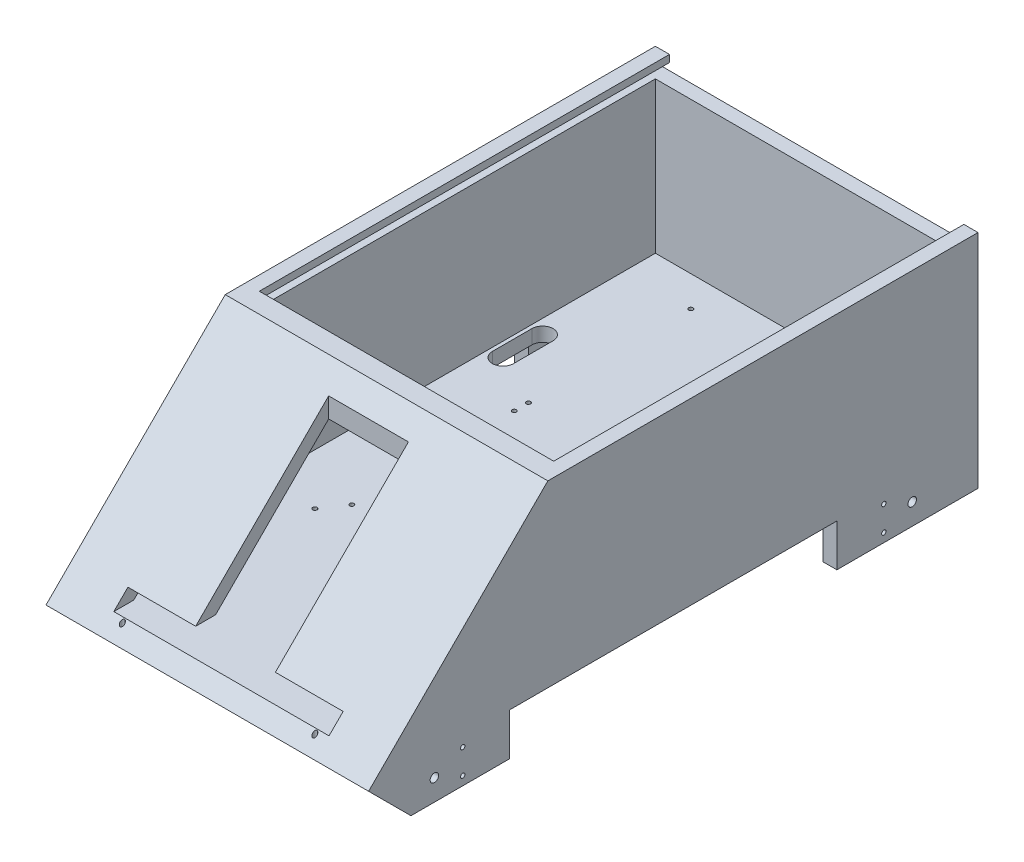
ISO-10303-21;
HEADER;
FILE_DESCRIPTION(('STEP AP214'),'2;1');
FILE_NAME('part.step','',(''),(''),'','','');
FILE_SCHEMA(('AUTOMOTIVE_DESIGN { 1 0 10303 214 1 1 1 1 }'));
ENDSEC;
DATA;
#1=APPLICATION_CONTEXT('core data for automotive mechanical design processes');
#2=APPLICATION_PROTOCOL_DEFINITION('international standard','automotive_design',2000,#1);
#3=PRODUCT_CONTEXT('',#1,'mechanical');
#4=PRODUCT('Part','Part','',(#3));
#5=PRODUCT_RELATED_PRODUCT_CATEGORY('part','',(#4));
#6=PRODUCT_DEFINITION_FORMATION('','',#4);
#7=PRODUCT_DEFINITION_CONTEXT('part definition',#1,'design');
#8=PRODUCT_DEFINITION('design','',#6,#7);
#9=PRODUCT_DEFINITION_SHAPE('','',#8);
#10=(LENGTH_UNIT() NAMED_UNIT(*) SI_UNIT(.MILLI.,.METRE.));
#11=(NAMED_UNIT(*) PLANE_ANGLE_UNIT() SI_UNIT($,.RADIAN.));
#12=(NAMED_UNIT(*) SI_UNIT($,.STERADIAN.) SOLID_ANGLE_UNIT());
#13=UNCERTAINTY_MEASURE_WITH_UNIT(LENGTH_MEASURE(1.E-05),#10,'distance_accuracy_value','');
#14=(GEOMETRIC_REPRESENTATION_CONTEXT(3) GLOBAL_UNCERTAINTY_ASSIGNED_CONTEXT((#13)) GLOBAL_UNIT_ASSIGNED_CONTEXT((#10,
#11,#12)) REPRESENTATION_CONTEXT('',''));
#15=CARTESIAN_POINT('',(0.,0.,0.));
#16=DIRECTION('',(0.,0.,1.));
#17=DIRECTION('',(1.,0.,0.));
#18=AXIS2_PLACEMENT_3D('',#15,#16,#17);
#19=CARTESIAN_POINT('',(114.3,0.,0.));
#20=DIRECTION('',(0.,1.,0.));
#21=DIRECTION('',(0.,0.,1.));
#22=AXIS2_PLACEMENT_3D('',#19,#20,#21);
#23=PLANE('',#22);
#24=CARTESIAN_POINT('',(-57.54,0.,-275.02));
#25=DIRECTION('',(0.,-1.,0.));
#26=DIRECTION('',(0.,0.,-1.));
#27=AXIS2_PLACEMENT_3D('',#24,#25,#26);
#28=CIRCLE('',#27,1.5);
#29=CARTESIAN_POINT('',(-57.54,0.,-276.52));
#30=VERTEX_POINT('',#29);
#31=EDGE_CURVE('E1028',#30,#30,#28,.T.);
#32=ORIENTED_EDGE('',*,*,#31,.F.);
#33=EDGE_LOOP('',(#32));
#34=FACE_BOUND('',#33,.T.);
#35=CARTESIAN_POINT('',(-57.54,0.,-159.94));
#36=DIRECTION('',(0.,-1.,0.));
#37=DIRECTION('',(0.,0.,-1.));
#38=AXIS2_PLACEMENT_3D('',#35,#36,#37);
#39=CIRCLE('',#38,1.5);
#40=CARTESIAN_POINT('',(-57.54,0.,-161.44));
#41=VERTEX_POINT('',#40);
#42=EDGE_CURVE('E1032',#41,#41,#39,.T.);
#43=ORIENTED_EDGE('',*,*,#42,.F.);
#44=EDGE_LOOP('',(#43));
#45=FACE_BOUND('',#44,.T.);
#46=CARTESIAN_POINT('',(57.54,0.,-159.94));
#47=DIRECTION('',(0.,-1.,0.));
#48=DIRECTION('',(0.,0.,1.));
#49=AXIS2_PLACEMENT_3D('',#46,#47,#48);
#50=CIRCLE('',#49,1.5);
#51=CARTESIAN_POINT('',(57.54,0.,-158.44));
#52=VERTEX_POINT('',#51);
#53=EDGE_CURVE('E1036',#52,#52,#50,.T.);
#54=ORIENTED_EDGE('',*,*,#53,.F.);
#55=EDGE_LOOP('',(#54));
#56=FACE_BOUND('',#55,.T.);
#57=CARTESIAN_POINT('',(57.54,0.,-285.1));
#58=DIRECTION('',(0.,-1.,0.));
#59=DIRECTION('',(0.,0.,1.));
#60=AXIS2_PLACEMENT_3D('',#57,#58,#59);
#61=CIRCLE('',#60,1.5);
#62=CARTESIAN_POINT('',(57.54,0.,-283.6));
#63=VERTEX_POINT('',#62);
#64=EDGE_CURVE('E1040',#63,#63,#61,.T.);
#65=ORIENTED_EDGE('',*,*,#64,.F.);
#66=EDGE_LOOP('',(#65));
#67=FACE_BOUND('',#66,.T.);
#68=CARTESIAN_POINT('',(-57.54,0.,-400.18));
#69=DIRECTION('',(0.,-1.,0.));
#70=DIRECTION('',(0.,0.,-1.));
#71=AXIS2_PLACEMENT_3D('',#68,#69,#70);
#72=CIRCLE('',#71,1.50000000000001);
#73=CARTESIAN_POINT('',(-57.54,0.,-401.68));
#74=VERTEX_POINT('',#73);
#75=EDGE_CURVE('E1044',#74,#74,#72,.T.);
#76=ORIENTED_EDGE('',*,*,#75,.F.);
#77=EDGE_LOOP('',(#76));
#78=FACE_BOUND('',#77,.T.);
#79=CARTESIAN_POINT('',(-57.54,0.,-285.1));
#80=DIRECTION('',(0.,-1.,0.));
#81=DIRECTION('',(0.,0.,-1.));
#82=AXIS2_PLACEMENT_3D('',#79,#80,#81);
#83=CIRCLE('',#82,1.5);
#84=CARTESIAN_POINT('',(-57.54,0.,-286.6));
#85=VERTEX_POINT('',#84);
#86=EDGE_CURVE('E1048',#85,#85,#83,.T.);
#87=ORIENTED_EDGE('',*,*,#86,.F.);
#88=EDGE_LOOP('',(#87));
#89=FACE_BOUND('',#88,.T.);
#90=CARTESIAN_POINT('',(57.54,0.,-400.18));
#91=DIRECTION('',(0.,-1.,0.));
#92=DIRECTION('',(0.,0.,1.));
#93=AXIS2_PLACEMENT_3D('',#90,#91,#92);
#94=CIRCLE('',#93,1.50000000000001);
#95=CARTESIAN_POINT('',(57.54,0.,-398.68));
#96=VERTEX_POINT('',#95);
#97=EDGE_CURVE('E1052',#96,#96,#94,.T.);
#98=ORIENTED_EDGE('',*,*,#97,.F.);
#99=EDGE_LOOP('',(#98));
#100=FACE_BOUND('',#99,.T.);
#101=CARTESIAN_POINT('',(57.54,0.,-275.02));
#102=DIRECTION('',(0.,-1.,0.));
#103=DIRECTION('',(0.,0.,1.));
#104=AXIS2_PLACEMENT_3D('',#101,#102,#103);
#105=CIRCLE('',#104,1.5);
#106=CARTESIAN_POINT('',(57.54,0.,-273.52));
#107=VERTEX_POINT('',#106);
#108=EDGE_CURVE('E1056',#107,#107,#105,.T.);
#109=ORIENTED_EDGE('',*,*,#108,.F.);
#110=EDGE_LOOP('',(#109));
#111=FACE_BOUND('',#110,.T.);
#112=CARTESIAN_POINT('',(-68.2,0.,-8.));
#113=DIRECTION('',(0.,-1.,0.));
#114=DIRECTION('',(0.,0.,-1.));
#115=AXIS2_PLACEMENT_3D('',#112,#113,#114);
#116=CIRCLE('',#115,1.54999999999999);
#117=CARTESIAN_POINT('',(-68.2,0.,-9.54999999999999));
#118=VERTEX_POINT('',#117);
#119=EDGE_CURVE('E847',#118,#118,#116,.T.);
#120=ORIENTED_EDGE('',*,*,#119,.F.);
#121=EDGE_LOOP('',(#120));
#122=FACE_BOUND('',#121,.T.);
#123=CARTESIAN_POINT('',(68.2,0.,-144.4));
#124=DIRECTION('',(0.,-1.,0.));
#125=DIRECTION('',(0.,0.,1.));
#126=AXIS2_PLACEMENT_3D('',#123,#124,#125);
#127=CIRCLE('',#126,1.54999999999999);
#128=CARTESIAN_POINT('',(68.2,0.,-142.85));
#129=VERTEX_POINT('',#128);
#130=EDGE_CURVE('E1063',#129,#129,#127,.T.);
#131=ORIENTED_EDGE('',*,*,#130,.F.);
#132=EDGE_LOOP('',(#131));
#133=FACE_BOUND('',#132,.T.);
#134=CARTESIAN_POINT('',(68.2,0.,-8.));
#135=DIRECTION('',(0.,-1.,0.));
#136=DIRECTION('',(0.,0.,1.));
#137=AXIS2_PLACEMENT_3D('',#134,#135,#136);
#138=CIRCLE('',#137,1.54999999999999);
#139=CARTESIAN_POINT('',(68.2,0.,-6.45000000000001));
#140=VERTEX_POINT('',#139);
#141=EDGE_CURVE('E1067',#140,#140,#138,.T.);
#142=ORIENTED_EDGE('',*,*,#141,.F.);
#143=EDGE_LOOP('',(#142));
#144=FACE_BOUND('',#143,.T.);
#145=CARTESIAN_POINT('',(-68.2,0.,-144.4));
#146=DIRECTION('',(0.,-1.,0.));
#147=DIRECTION('',(0.,0.,-1.));
#148=AXIS2_PLACEMENT_3D('',#145,#146,#147);
#149=CIRCLE('',#148,1.54999999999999);
#150=CARTESIAN_POINT('',(-68.2,0.,-145.95));
#151=VERTEX_POINT('',#150);
#152=EDGE_CURVE('E842',#151,#151,#149,.T.);
#153=ORIENTED_EDGE('',*,*,#152,.F.);
#154=EDGE_LOOP('',(#153));
#155=FACE_BOUND('',#154,.T.);
#156=DIRECTION('',(0.,0.,-1.));
#157=VECTOR('',#156,1.);
#158=CARTESIAN_POINT('',(-86.8,0.,-128.));
#159=LINE('',#158,#157);
#160=CARTESIAN_POINT('',(-86.8,0.,-100.));
#161=VERTEX_POINT('',#160);
#162=CARTESIAN_POINT('',(-86.8,0.,-128.));
#163=VERTEX_POINT('',#162);
#164=EDGE_CURVE('E394',#161,#163,#159,.T.);
#165=ORIENTED_EDGE('',*,*,#164,.T.);
#166=CARTESIAN_POINT('',(-94.3,0.,-128.));
#167=DIRECTION('',(0.,1.,0.));
#168=DIRECTION('',(0.,0.,1.));
#169=AXIS2_PLACEMENT_3D('',#166,#167,#168);
#170=CIRCLE('',#169,7.49999999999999);
#171=CARTESIAN_POINT('',(-101.8,0.,-128.));
#172=VERTEX_POINT('',#171);
#173=EDGE_CURVE('E386',#163,#172,#170,.T.);
#174=ORIENTED_EDGE('',*,*,#173,.T.);
#175=DIRECTION('',(0.,0.,1.));
#176=VECTOR('',#175,1.);
#177=CARTESIAN_POINT('',(-101.8,0.,-128.));
#178=LINE('',#177,#176);
#179=CARTESIAN_POINT('',(-101.8,0.,-100.));
#180=VERTEX_POINT('',#179);
#181=EDGE_CURVE('E397',#172,#180,#178,.T.);
#182=ORIENTED_EDGE('',*,*,#181,.T.);
#183=CARTESIAN_POINT('',(-94.3,0.,-100.));
#184=DIRECTION('',(0.,1.,0.));
#185=DIRECTION('',(0.,0.,1.));
#186=AXIS2_PLACEMENT_3D('',#183,#184,#185);
#187=CIRCLE('',#186,7.49999999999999);
#188=EDGE_CURVE('E57',#180,#161,#187,.T.);
#189=ORIENTED_EDGE('',*,*,#188,.T.);
#190=EDGE_LOOP('',(#165,#174,#182,#189));
#191=FACE_BOUND('',#190,.T.);
#192=DIRECTION('',(0.,0.,-1.));
#193=VECTOR('',#192,1.);
#194=CARTESIAN_POINT('',(101.8,0.,-128.));
#195=LINE('',#194,#193);
#196=CARTESIAN_POINT('',(101.8,0.,-100.));
#197=VERTEX_POINT('',#196);
#198=CARTESIAN_POINT('',(101.8,0.,-128.));
#199=VERTEX_POINT('',#198);
#200=EDGE_CURVE('E429',#197,#199,#195,.T.);
#201=ORIENTED_EDGE('',*,*,#200,.T.);
#202=CARTESIAN_POINT('',(94.3,0.,-128.));
#203=DIRECTION('',(0.,1.,0.));
#204=DIRECTION('',(0.,0.,-1.));
#205=AXIS2_PLACEMENT_3D('',#202,#203,#204);
#206=CIRCLE('',#205,7.49999999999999);
#207=CARTESIAN_POINT('',(86.8,0.,-128.));
#208=VERTEX_POINT('',#207);
#209=EDGE_CURVE('E440',#199,#208,#206,.T.);
#210=ORIENTED_EDGE('',*,*,#209,.T.);
#211=DIRECTION('',(0.,0.,1.));
#212=VECTOR('',#211,1.);
#213=CARTESIAN_POINT('',(86.8,0.,-128.));
#214=LINE('',#213,#212);
#215=CARTESIAN_POINT('',(86.8,0.,-100.));
#216=VERTEX_POINT('',#215);
#217=EDGE_CURVE('E450',#208,#216,#214,.T.);
#218=ORIENTED_EDGE('',*,*,#217,.T.);
#219=CARTESIAN_POINT('',(94.3,0.,-100.));
#220=DIRECTION('',(0.,1.,0.));
#221=DIRECTION('',(0.,0.,-1.));
#222=AXIS2_PLACEMENT_3D('',#219,#220,#221);
#223=CIRCLE('',#222,7.49999999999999);
#224=EDGE_CURVE('E65',#216,#197,#223,.T.);
#225=ORIENTED_EDGE('',*,*,#224,.T.);
#226=EDGE_LOOP('',(#201,#210,#218,#225));
#227=FACE_BOUND('',#226,.T.);
#228=DIRECTION('',(0.,0.,-1.));
#229=VECTOR('',#228,1.);
#230=CARTESIAN_POINT('',(-86.8,0.,-331.8));
#231=LINE('',#230,#229);
#232=CARTESIAN_POINT('',(-86.8,0.,-303.8));
#233=VERTEX_POINT('',#232);
#234=CARTESIAN_POINT('',(-86.8,0.,-331.8));
#235=VERTEX_POINT('',#234);
#236=EDGE_CURVE('E465',#233,#235,#231,.T.);
#237=ORIENTED_EDGE('',*,*,#236,.T.);
#238=CARTESIAN_POINT('',(-94.3,0.,-331.8));
#239=DIRECTION('',(0.,1.,0.));
#240=DIRECTION('',(0.,0.,1.));
#241=AXIS2_PLACEMENT_3D('',#238,#239,#240);
#242=CIRCLE('',#241,7.49999999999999);
#243=CARTESIAN_POINT('',(-101.8,0.,-331.8));
#244=VERTEX_POINT('',#243);
#245=EDGE_CURVE('E455',#235,#244,#242,.T.);
#246=ORIENTED_EDGE('',*,*,#245,.T.);
#247=DIRECTION('',(0.,0.,1.));
#248=VECTOR('',#247,1.);
#249=CARTESIAN_POINT('',(-101.8,0.,-331.8));
#250=LINE('',#249,#248);
#251=CARTESIAN_POINT('',(-101.8,0.,-303.8));
#252=VERTEX_POINT('',#251);
#253=EDGE_CURVE('E458',#244,#252,#250,.T.);
#254=ORIENTED_EDGE('',*,*,#253,.T.);
#255=CARTESIAN_POINT('',(-94.3,0.,-303.8));
#256=DIRECTION('',(0.,1.,0.));
#257=DIRECTION('',(0.,0.,1.));
#258=AXIS2_PLACEMENT_3D('',#255,#256,#257);
#259=CIRCLE('',#258,7.49999999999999);
#260=EDGE_CURVE('E462',#252,#233,#259,.T.);
#261=ORIENTED_EDGE('',*,*,#260,.T.);
#262=EDGE_LOOP('',(#237,#246,#254,#261));
#263=FACE_BOUND('',#262,.T.);
#264=DIRECTION('',(0.,0.,-1.));
#265=VECTOR('',#264,1.);
#266=CARTESIAN_POINT('',(101.8,0.,-331.8));
#267=LINE('',#266,#265);
#268=CARTESIAN_POINT('',(101.8,0.,-303.8));
#269=VERTEX_POINT('',#268);
#270=CARTESIAN_POINT('',(101.8,0.,-331.8));
#271=VERTEX_POINT('',#270);
#272=EDGE_CURVE('E492',#269,#271,#267,.T.);
#273=ORIENTED_EDGE('',*,*,#272,.T.);
#274=CARTESIAN_POINT('',(94.3,0.,-331.8));
#275=DIRECTION('',(0.,1.,0.));
#276=DIRECTION('',(0.,0.,-1.));
#277=AXIS2_PLACEMENT_3D('',#274,#275,#276);
#278=CIRCLE('',#277,7.49999999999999);
#279=CARTESIAN_POINT('',(86.8,0.,-331.8));
#280=VERTEX_POINT('',#279);
#281=EDGE_CURVE('E502',#271,#280,#278,.T.);
#282=ORIENTED_EDGE('',*,*,#281,.T.);
#283=DIRECTION('',(0.,0.,1.));
#284=VECTOR('',#283,1.);
#285=CARTESIAN_POINT('',(86.8,0.,-331.8));
#286=LINE('',#285,#284);
#287=CARTESIAN_POINT('',(86.8,0.,-303.8));
#288=VERTEX_POINT('',#287);
#289=EDGE_CURVE('E514',#280,#288,#286,.T.);
#290=ORIENTED_EDGE('',*,*,#289,.T.);
#291=CARTESIAN_POINT('',(94.3,0.,-303.8));
#292=DIRECTION('',(0.,1.,0.));
#293=DIRECTION('',(0.,0.,-1.));
#294=AXIS2_PLACEMENT_3D('',#291,#292,#293);
#295=CIRCLE('',#294,7.49999999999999);
#296=EDGE_CURVE('E511',#288,#269,#295,.T.);
#297=ORIENTED_EDGE('',*,*,#296,.T.);
#298=EDGE_LOOP('',(#273,#282,#290,#297));
#299=FACE_BOUND('',#298,.T.);
#300=DIRECTION('',(0.,0.,-1.));
#301=VECTOR('',#300,1.);
#302=CARTESIAN_POINT('',(-104.3,0.,0.));
#303=LINE('',#302,#301);
#304=CARTESIAN_POINT('',(-104.3,0.,0.));
#305=VERTEX_POINT('',#304);
#306=CARTESIAN_POINT('',(-104.3,0.,-100.));
#307=VERTEX_POINT('',#306);
#308=EDGE_CURVE('E519',#305,#307,#303,.T.);
#309=ORIENTED_EDGE('',*,*,#308,.T.);
#310=DIRECTION('',(-1.,0.,0.));
#311=VECTOR('',#310,1.);
#312=CARTESIAN_POINT('',(-104.3,0.,-100.));
#313=LINE('',#312,#311);
#314=CARTESIAN_POINT('',(-114.3,0.,-100.));
#315=VERTEX_POINT('',#314);
#316=EDGE_CURVE('E531',#307,#315,#313,.T.);
#317=ORIENTED_EDGE('',*,*,#316,.T.);
#318=DIRECTION('',(0.,0.,-1.));
#319=VECTOR('',#318,1.);
#320=CARTESIAN_POINT('',(-114.3,0.,0.));
#321=LINE('',#320,#319);
#322=CARTESIAN_POINT('',(-114.3,0.,-331.8));
#323=VERTEX_POINT('',#322);
#324=EDGE_CURVE('E735',#315,#323,#321,.T.);
#325=ORIENTED_EDGE('',*,*,#324,.T.);
#326=DIRECTION('',(-1.,0.,0.));
#327=VECTOR('',#326,1.);
#328=CARTESIAN_POINT('',(-104.3,0.,-331.8));
#329=LINE('',#328,#327);
#330=CARTESIAN_POINT('',(-104.3,0.,-331.8));
#331=VERTEX_POINT('',#330);
#332=EDGE_CURVE('E482',#331,#323,#329,.T.);
#333=ORIENTED_EDGE('',*,*,#332,.F.);
#334=DIRECTION('',(0.,0.,-1.));
#335=VECTOR('',#334,1.);
#336=CARTESIAN_POINT('',(-104.3,0.,-431.8));
#337=LINE('',#336,#335);
#338=CARTESIAN_POINT('',(-104.3,0.,-431.8));
#339=VERTEX_POINT('',#338);
#340=EDGE_CURVE('E554',#331,#339,#337,.T.);
#341=ORIENTED_EDGE('',*,*,#340,.T.);
#342=DIRECTION('',(-1.,0.,0.));
#343=VECTOR('',#342,1.);
#344=CARTESIAN_POINT('',(114.3,0.,-431.8));
#345=LINE('',#344,#343);
#346=CARTESIAN_POINT('',(104.3,0.,-431.8));
#347=VERTEX_POINT('',#346);
#348=EDGE_CURVE('E795',#347,#339,#345,.T.);
#349=ORIENTED_EDGE('',*,*,#348,.F.);
#350=DIRECTION('',(0.,0.,1.));
#351=VECTOR('',#350,1.);
#352=CARTESIAN_POINT('',(104.3,0.,-431.8));
#353=LINE('',#352,#351);
#354=CARTESIAN_POINT('',(104.3,0.,-331.8));
#355=VERTEX_POINT('',#354);
#356=EDGE_CURVE('E622',#347,#355,#353,.T.);
#357=ORIENTED_EDGE('',*,*,#356,.T.);
#358=DIRECTION('',(1.,0.,0.));
#359=VECTOR('',#358,1.);
#360=CARTESIAN_POINT('',(104.3,0.,-331.8));
#361=LINE('',#360,#359);
#362=CARTESIAN_POINT('',(114.3,0.,-331.8));
#363=VERTEX_POINT('',#362);
#364=EDGE_CURVE('E603',#355,#363,#361,.T.);
#365=ORIENTED_EDGE('',*,*,#364,.T.);
#366=DIRECTION('',(0.,0.,-1.));
#367=VECTOR('',#366,1.);
#368=CARTESIAN_POINT('',(114.3,0.,0.));
#369=LINE('',#368,#367);
#370=CARTESIAN_POINT('',(114.3,0.,-100.));
#371=VERTEX_POINT('',#370);
#372=EDGE_CURVE('E765',#371,#363,#369,.T.);
#373=ORIENTED_EDGE('',*,*,#372,.F.);
#374=DIRECTION('',(1.,0.,0.));
#375=VECTOR('',#374,1.);
#376=CARTESIAN_POINT('',(104.3,0.,-100.));
#377=LINE('',#376,#375);
#378=CARTESIAN_POINT('',(104.3,0.,-100.));
#379=VERTEX_POINT('',#378);
#380=EDGE_CURVE('E597',#379,#371,#377,.T.);
#381=ORIENTED_EDGE('',*,*,#380,.F.);
#382=DIRECTION('',(0.,0.,1.));
#383=VECTOR('',#382,1.);
#384=CARTESIAN_POINT('',(104.3,0.,0.));
#385=LINE('',#384,#383);
#386=CARTESIAN_POINT('',(104.3,0.,0.));
#387=VERTEX_POINT('',#386);
#388=EDGE_CURVE('E574',#379,#387,#385,.T.);
#389=ORIENTED_EDGE('',*,*,#388,.T.);
#390=DIRECTION('',(-1.,0.,0.));
#391=VECTOR('',#390,1.);
#392=CARTESIAN_POINT('',(114.3,0.,0.));
#393=LINE('',#392,#391);
#394=EDGE_CURVE('E776',#387,#305,#393,.T.);
#395=ORIENTED_EDGE('',*,*,#394,.T.);
#396=EDGE_LOOP('',(#309,#317,#325,#333,#341,#349,#357,#365,#373,#381,#389,#395));
#397=FACE_BOUND('',#396,.T.);
#398=ADVANCED_FACE('F41',(#34,#45,#56,#67,#78,#89,#100,#111,#122,#133,#144,#155,#191,#227,#263,
#299,#397),#23,.F.);
#399=CARTESIAN_POINT('',(114.3,0.,0.));
#400=DIRECTION('',(0.,0.707106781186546,0.707106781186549));
#401=DIRECTION('',(0.,-0.707106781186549,0.707106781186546));
#402=AXIS2_PLACEMENT_3D('',#399,#400,#401);
#403=PLANE('',#402);
#404=CARTESIAN_POINT('',(-68.2,8.00000000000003,-8.));
#405=DIRECTION('',(0.,0.707106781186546,0.707106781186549));
#406=DIRECTION('',(0.,-0.707106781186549,0.707106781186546));
#407=AXIS2_PLACEMENT_3D('',#404,#405,#406);
#408=ELLIPSE('',#407,2.19203102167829,1.54999999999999);
#409=CARTESIAN_POINT('',(-68.2,6.45000000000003,-6.45000000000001));
#410=VERTEX_POINT('',#409);
#411=EDGE_CURVE('E44',#410,#410,#408,.T.);
#412=ORIENTED_EDGE('',*,*,#411,.F.);
#413=EDGE_LOOP('',(#412));
#414=FACE_BOUND('',#413,.T.);
#415=CARTESIAN_POINT('',(68.2,8.00000000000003,-8.));
#416=DIRECTION('',(0.,0.707106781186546,0.707106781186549));
#417=DIRECTION('',(0.,-0.707106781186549,0.707106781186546));
#418=AXIS2_PLACEMENT_3D('',#415,#416,#417);
#419=ELLIPSE('',#418,2.19203102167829,1.54999999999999);
#420=CARTESIAN_POINT('',(68.2,6.45000000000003,-6.45000000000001));
#421=VERTEX_POINT('',#420);
#422=EDGE_CURVE('E834',#421,#421,#419,.T.);
#423=ORIENTED_EDGE('',*,*,#422,.F.);
#424=EDGE_LOOP('',(#423));
#425=FACE_BOUND('',#424,.T.);
#426=DIRECTION('',(0.,0.707106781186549,-0.707106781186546));
#427=VECTOR('',#426,1.);
#428=CARTESIAN_POINT('',(-114.3,0.,0.));
#429=LINE('',#428,#427);
#430=CARTESIAN_POINT('',(-114.3,0.,0.));
#431=VERTEX_POINT('',#430);
#432=CARTESIAN_POINT('',(-114.3,127.,-127.));
#433=VERTEX_POINT('',#432);
#434=EDGE_CURVE('E769',#431,#433,#429,.T.);
#435=ORIENTED_EDGE('',*,*,#434,.F.);
#436=DIRECTION('',(-1.,0.,0.));
#437=VECTOR('',#436,1.);
#438=CARTESIAN_POINT('',(-104.3,0.,0.));
#439=LINE('',#438,#437);
#440=EDGE_CURVE('E541',#305,#431,#439,.T.);
#441=ORIENTED_EDGE('',*,*,#440,.F.);
#442=ORIENTED_EDGE('',*,*,#394,.F.);
#443=CARTESIAN_POINT('',(114.3,0.,0.));
#444=VERTEX_POINT('',#443);
#445=EDGE_CURVE('E786',#444,#387,#393,.T.);
#446=ORIENTED_EDGE('',*,*,#445,.F.);
#447=DIRECTION('',(0.,0.707106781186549,-0.707106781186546));
#448=VECTOR('',#447,1.);
#449=CARTESIAN_POINT('',(114.3,0.,0.));
#450=LINE('',#449,#448);
#451=CARTESIAN_POINT('',(114.3,127.,-127.));
#452=VERTEX_POINT('',#451);
#453=EDGE_CURVE('E773',#444,#452,#450,.T.);
#454=ORIENTED_EDGE('',*,*,#453,.T.);
#455=DIRECTION('',(-1.,0.,0.));
#456=VECTOR('',#455,1.);
#457=CARTESIAN_POINT('',(114.3,127.,-127.));
#458=LINE('',#457,#456);
#459=EDGE_CURVE('E789',#452,#433,#458,.T.);
#460=ORIENTED_EDGE('',*,*,#459,.T.);
#461=EDGE_LOOP('',(#435,#441,#442,#446,#454,#460));
#462=FACE_BOUND('',#461,.T.);
#463=DIRECTION('',(1.,0.,0.));
#464=VECTOR('',#463,1.);
#465=CARTESIAN_POINT('',(114.3,20.,-19.9999999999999));
#466=LINE('',#465,#464);
#467=CARTESIAN_POINT('',(-76.25,20.,-19.9999999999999));
#468=VERTEX_POINT('',#467);
#469=CARTESIAN_POINT('',(-28.25,20.,-19.9999999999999));
#470=VERTEX_POINT('',#469);
#471=EDGE_CURVE('E665',#468,#470,#466,.T.);
#472=ORIENTED_EDGE('',*,*,#471,.T.);
#473=DIRECTION('',(0.,0.707106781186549,-0.707106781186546));
#474=VECTOR('',#473,1.);
#475=CARTESIAN_POINT('',(-28.25,0.,0.));
#476=LINE('',#475,#474);
#477=CARTESIAN_POINT('',(-28.25,114.25,-114.25));
#478=VERTEX_POINT('',#477);
#479=EDGE_CURVE('E640',#470,#478,#476,.T.);
#480=ORIENTED_EDGE('',*,*,#479,.T.);
#481=DIRECTION('',(1.,0.,0.));
#482=VECTOR('',#481,1.);
#483=CARTESIAN_POINT('',(114.3,114.25,-114.25));
#484=LINE('',#483,#482);
#485=CARTESIAN_POINT('',(28.25,114.25,-114.25));
#486=VERTEX_POINT('',#485);
#487=EDGE_CURVE('E645',#478,#486,#484,.T.);
#488=ORIENTED_EDGE('',*,*,#487,.T.);
#489=DIRECTION('',(0.,-0.707106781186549,0.707106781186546));
#490=VECTOR('',#489,1.);
#491=CARTESIAN_POINT('',(28.25,0.,0.));
#492=LINE('',#491,#490);
#493=CARTESIAN_POINT('',(28.25,20.,-19.9999999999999));
#494=VERTEX_POINT('',#493);
#495=EDGE_CURVE('E650',#486,#494,#492,.T.);
#496=ORIENTED_EDGE('',*,*,#495,.T.);
#497=CARTESIAN_POINT('',(76.25,20.,-19.9999999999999));
#498=VERTEX_POINT('',#497);
#499=EDGE_CURVE('E660',#494,#498,#466,.T.);
#500=ORIENTED_EDGE('',*,*,#499,.T.);
#501=DIRECTION('',(0.,-0.707106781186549,0.707106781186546));
#502=VECTOR('',#501,1.);
#503=CARTESIAN_POINT('',(76.25,0.,0.));
#504=LINE('',#503,#502);
#505=CARTESIAN_POINT('',(76.25,10.,-9.99999999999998));
#506=VERTEX_POINT('',#505);
#507=EDGE_CURVE('E668',#498,#506,#504,.T.);
#508=ORIENTED_EDGE('',*,*,#507,.T.);
#509=DIRECTION('',(1.,0.,0.));
#510=VECTOR('',#509,1.);
#511=CARTESIAN_POINT('',(-76.25,10.,-9.99999999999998));
#512=LINE('',#511,#510);
#513=CARTESIAN_POINT('',(-76.25,10.,-9.99999999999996));
#514=VERTEX_POINT('',#513);
#515=EDGE_CURVE('E662',#514,#506,#512,.T.);
#516=ORIENTED_EDGE('',*,*,#515,.F.);
#517=DIRECTION('',(0.,0.707106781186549,-0.707106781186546));
#518=VECTOR('',#517,1.);
#519=CARTESIAN_POINT('',(-76.25,0.,0.));
#520=LINE('',#519,#518);
#521=EDGE_CURVE('E671',#514,#468,#520,.T.);
#522=ORIENTED_EDGE('',*,*,#521,.T.);
#523=EDGE_LOOP('',(#472,#480,#488,#496,#500,#508,#516,#522));
#524=FACE_BOUND('',#523,.T.);
#525=ADVANCED_FACE('F984',(#414,#425,#462,#524),#403,.T.);
#526=CARTESIAN_POINT('',(114.3,-7.07106781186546,-7.07106781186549));
#527=DIRECTION('',(0.,0.707106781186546,0.707106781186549));
#528=DIRECTION('',(0.,-0.707106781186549,0.707106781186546));
#529=AXIS2_PLACEMENT_3D('',#526,#527,#528);
#530=PLANE('',#529);
#531=DIRECTION('',(0.,0.707106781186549,-0.707106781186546));
#532=VECTOR('',#531,1.);
#533=CARTESIAN_POINT('',(-28.25,-7.07106781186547,-7.07106781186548));
#534=LINE('',#533,#532);
#535=CARTESIAN_POINT('',(-28.25,20.,-34.1421356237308));
#536=VERTEX_POINT('',#535);
#537=CARTESIAN_POINT('',(-28.25,100.107864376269,-114.25));
#538=VERTEX_POINT('',#537);
#539=EDGE_CURVE('E638',#536,#538,#534,.T.);
#540=ORIENTED_EDGE('',*,*,#539,.F.);
#541=DIRECTION('',(1.,0.,0.));
#542=VECTOR('',#541,1.);
#543=CARTESIAN_POINT('',(114.3,20.,-34.1421356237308));
#544=LINE('',#543,#542);
#545=CARTESIAN_POINT('',(-76.25,20.,-34.1421356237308));
#546=VERTEX_POINT('',#545);
#547=EDGE_CURVE('E806',#546,#536,#544,.T.);
#548=ORIENTED_EDGE('',*,*,#547,.F.);
#549=DIRECTION('',(0.,0.707106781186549,-0.707106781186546));
#550=VECTOR('',#549,1.);
#551=CARTESIAN_POINT('',(-76.25,-7.07106781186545,-7.0710678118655));
#552=LINE('',#551,#550);
#553=CARTESIAN_POINT('',(-76.25,10.,-24.1421356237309));
#554=VERTEX_POINT('',#553);
#555=EDGE_CURVE('E11',#554,#546,#552,.T.);
#556=ORIENTED_EDGE('',*,*,#555,.F.);
#557=DIRECTION('',(-1.,0.,0.));
#558=VECTOR('',#557,1.);
#559=CARTESIAN_POINT('',(114.3,10.,-24.1421356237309));
#560=LINE('',#559,#558);
#561=CARTESIAN_POINT('',(-104.3,10.,-24.1421356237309));
#562=VERTEX_POINT('',#561);
#563=EDGE_CURVE('E745',#554,#562,#560,.T.);
#564=ORIENTED_EDGE('',*,*,#563,.T.);
#565=DIRECTION('',(0.,0.707106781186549,-0.707106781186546));
#566=VECTOR('',#565,1.);
#567=CARTESIAN_POINT('',(-104.3,-7.07106781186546,-7.07106781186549));
#568=LINE('',#567,#566);
#569=CARTESIAN_POINT('',(-104.3,117.85786437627,-132.));
#570=VERTEX_POINT('',#569);
#571=EDGE_CURVE('E741',#562,#570,#568,.T.);
#572=ORIENTED_EDGE('',*,*,#571,.T.);
#573=DIRECTION('',(-1.,0.,0.));
#574=VECTOR('',#573,1.);
#575=CARTESIAN_POINT('',(114.3,117.85786437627,-132.));
#576=LINE('',#575,#574);
#577=CARTESIAN_POINT('',(104.3,117.85786437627,-132.));
#578=VERTEX_POINT('',#577);
#579=EDGE_CURVE('E715',#578,#570,#576,.T.);
#580=ORIENTED_EDGE('',*,*,#579,.F.);
#581=DIRECTION('',(0.,0.707106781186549,-0.707106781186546));
#582=VECTOR('',#581,1.);
#583=CARTESIAN_POINT('',(104.3,-7.07106781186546,-7.07106781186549));
#584=LINE('',#583,#582);
#585=CARTESIAN_POINT('',(104.3,10.,-24.1421356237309));
#586=VERTEX_POINT('',#585);
#587=EDGE_CURVE('E752',#586,#578,#584,.T.);
#588=ORIENTED_EDGE('',*,*,#587,.F.);
#589=CARTESIAN_POINT('',(76.25,10.,-24.1421356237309));
#590=VERTEX_POINT('',#589);
#591=EDGE_CURVE('E742',#586,#590,#560,.T.);
#592=ORIENTED_EDGE('',*,*,#591,.T.);
#593=DIRECTION('',(0.,-0.707106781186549,0.707106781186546));
#594=VECTOR('',#593,1.);
#595=CARTESIAN_POINT('',(76.25,-7.07106781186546,-7.07106781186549));
#596=LINE('',#595,#594);
#597=CARTESIAN_POINT('',(76.25,20.,-34.1421356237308));
#598=VERTEX_POINT('',#597);
#599=EDGE_CURVE('E49',#598,#590,#596,.T.);
#600=ORIENTED_EDGE('',*,*,#599,.F.);
#601=CARTESIAN_POINT('',(28.25,20.,-34.1421356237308));
#602=VERTEX_POINT('',#601);
#603=EDGE_CURVE('E805',#602,#598,#544,.T.);
#604=ORIENTED_EDGE('',*,*,#603,.F.);
#605=DIRECTION('',(0.,-0.707106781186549,0.707106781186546));
#606=VECTOR('',#605,1.);
#607=CARTESIAN_POINT('',(28.25,-7.07106781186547,-7.07106781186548));
#608=LINE('',#607,#606);
#609=CARTESIAN_POINT('',(28.25,100.107864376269,-114.25));
#610=VERTEX_POINT('',#609);
#611=EDGE_CURVE('E648',#610,#602,#608,.T.);
#612=ORIENTED_EDGE('',*,*,#611,.F.);
#613=DIRECTION('',(1.,0.,0.));
#614=VECTOR('',#613,1.);
#615=CARTESIAN_POINT('',(114.3,100.107864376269,-114.25));
#616=LINE('',#615,#614);
#617=EDGE_CURVE('E643',#538,#610,#616,.T.);
#618=ORIENTED_EDGE('',*,*,#617,.F.);
#619=EDGE_LOOP('',(#540,#548,#556,#564,#572,#580,#588,#592,#600,#604,#612,#618));
#620=FACE_BOUND('',#619,.T.);
#621=ADVANCED_FACE('F1022',(#620),#530,.F.);
#622=CARTESIAN_POINT('',(0.,20.,0.));
#623=DIRECTION('',(0.,-1.,0.));
#624=DIRECTION('',(0.,0.,-1.));
#625=AXIS2_PLACEMENT_3D('',#622,#623,#624);
#626=PLANE('',#625);
#627=ORIENTED_EDGE('',*,*,#547,.T.);
#628=DIRECTION('',(0.,0.,1.));
#629=VECTOR('',#628,1.);
#630=CARTESIAN_POINT('',(-28.25,20.,0.));
#631=LINE('',#630,#629);
#632=EDGE_CURVE('E629',#536,#470,#631,.T.);
#633=ORIENTED_EDGE('',*,*,#632,.T.);
#634=ORIENTED_EDGE('',*,*,#471,.F.);
#635=DIRECTION('',(0.,0.,1.));
#636=VECTOR('',#635,1.);
#637=CARTESIAN_POINT('',(-76.25,20.,-9.99999999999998));
#638=LINE('',#637,#636);
#639=EDGE_CURVE('E653',#546,#468,#638,.T.);
#640=ORIENTED_EDGE('',*,*,#639,.F.);
#641=EDGE_LOOP('',(#627,#633,#634,#640));
#642=FACE_BOUND('',#641,.T.);
#643=ADVANCED_FACE('F1667',(#642),#626,.T.);
#644=ORIENTED_EDGE('',*,*,#499,.F.);
#645=DIRECTION('',(0.,0.,-1.));
#646=VECTOR('',#645,1.);
#647=CARTESIAN_POINT('',(28.25,20.,0.));
#648=LINE('',#647,#646);
#649=EDGE_CURVE('E599',#494,#602,#648,.T.);
#650=ORIENTED_EDGE('',*,*,#649,.T.);
#651=ORIENTED_EDGE('',*,*,#603,.T.);
#652=DIRECTION('',(0.,0.,-1.));
#653=VECTOR('',#652,1.);
#654=CARTESIAN_POINT('',(76.25,20.,-162.));
#655=LINE('',#654,#653);
#656=EDGE_CURVE('E656',#498,#598,#655,.T.);
#657=ORIENTED_EDGE('',*,*,#656,.F.);
#658=EDGE_LOOP('',(#644,#650,#651,#657));
#659=FACE_BOUND('',#658,.T.);
#660=ADVANCED_FACE('F1661',(#659),#626,.T.);
#661=DIRECTION('',(1.,0.,0.));
#662=VECTOR('',#661,1.);
#663=CARTESIAN_POINT('',(114.3,122.,-136.14213562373));
#664=LINE('',#663,#662);
#665=CARTESIAN_POINT('',(-104.3,122.,-136.14213562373));
#666=VERTEX_POINT('',#665);
#667=CARTESIAN_POINT('',(104.3,122.,-136.14213562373));
#668=VERTEX_POINT('',#667);
#669=EDGE_CURVE('E719',#666,#668,#664,.T.);
#670=ORIENTED_EDGE('',*,*,#669,.F.);
#671=CARTESIAN_POINT('',(-104.3,127.,-141.14213562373));
#672=VERTEX_POINT('',#671);
#673=EDGE_CURVE('E758',#666,#672,#568,.T.);
#674=ORIENTED_EDGE('',*,*,#673,.T.);
#675=DIRECTION('',(-1.,0.,0.));
#676=VECTOR('',#675,1.);
#677=CARTESIAN_POINT('',(114.3,127.,-141.14213562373));
#678=LINE('',#677,#676);
#679=CARTESIAN_POINT('',(104.3,127.,-141.14213562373));
#680=VERTEX_POINT('',#679);
#681=EDGE_CURVE('E736',#680,#672,#678,.T.);
#682=ORIENTED_EDGE('',*,*,#681,.F.);
#683=EDGE_CURVE('E755',#668,#680,#584,.T.);
#684=ORIENTED_EDGE('',*,*,#683,.F.);
#685=EDGE_LOOP('',(#670,#674,#682,#684));
#686=FACE_BOUND('',#685,.T.);
#687=ADVANCED_FACE('F1666',(#686),#530,.F.);
#688=CARTESIAN_POINT('',(104.3,0.,0.));
#689=DIRECTION('',(1.,0.,0.));
#690=DIRECTION('',(0.,0.,-1.));
#691=AXIS2_PLACEMENT_3D('',#688,#689,#690);
#692=PLANE('',#691);
#693=DIRECTION('',(0.,0.,-1.));
#694=VECTOR('',#693,1.);
#695=CARTESIAN_POINT('',(104.3,122.,0.));
#696=LINE('',#695,#694);
#697=CARTESIAN_POINT('',(104.3,122.,-431.8));
#698=VERTEX_POINT('',#697);
#699=EDGE_CURVE('E721',#668,#698,#696,.T.);
#700=ORIENTED_EDGE('',*,*,#699,.F.);
#701=ORIENTED_EDGE('',*,*,#683,.T.);
#702=DIRECTION('',(0.,0.,1.));
#703=VECTOR('',#702,1.);
#704=CARTESIAN_POINT('',(104.3,127.,-431.8));
#705=LINE('',#704,#703);
#706=CARTESIAN_POINT('',(104.3,127.,-431.8));
#707=VERTEX_POINT('',#706);
#708=EDGE_CURVE('E751',#707,#680,#705,.T.);
#709=ORIENTED_EDGE('',*,*,#708,.F.);
#710=DIRECTION('',(0.,-1.,0.));
#711=VECTOR('',#710,1.);
#712=CARTESIAN_POINT('',(104.3,122.,-431.8));
#713=LINE('',#712,#711);
#714=EDGE_CURVE('E677',#707,#698,#713,.T.);
#715=ORIENTED_EDGE('',*,*,#714,.T.);
#716=EDGE_LOOP('',(#700,#701,#709,#715));
#717=FACE_BOUND('',#716,.T.);
#718=ADVANCED_FACE('F1730',(#717),#692,.F.);
#719=CARTESIAN_POINT('',(-104.3,0.,0.));
#720=DIRECTION('',(1.,0.,0.));
#721=DIRECTION('',(0.,0.,-1.));
#722=AXIS2_PLACEMENT_3D('',#719,#720,#721);
#723=PLANE('',#722);
#724=ORIENTED_EDGE('',*,*,#673,.F.);
#725=DIRECTION('',(0.,0.,-1.));
#726=VECTOR('',#725,1.);
#727=CARTESIAN_POINT('',(-104.3,122.,0.));
#728=LINE('',#727,#726);
#729=CARTESIAN_POINT('',(-104.3,122.,-431.8));
#730=VERTEX_POINT('',#729);
#731=EDGE_CURVE('E803',#666,#730,#728,.T.);
#732=ORIENTED_EDGE('',*,*,#731,.T.);
#733=DIRECTION('',(0.,1.,0.));
#734=VECTOR('',#733,1.);
#735=CARTESIAN_POINT('',(-104.3,127.,-431.8));
#736=LINE('',#735,#734);
#737=CARTESIAN_POINT('',(-104.3,127.,-431.8));
#738=VERTEX_POINT('',#737);
#739=EDGE_CURVE('E674',#730,#738,#736,.T.);
#740=ORIENTED_EDGE('',*,*,#739,.T.);
#741=DIRECTION('',(0.,0.,1.));
#742=VECTOR('',#741,1.);
#743=CARTESIAN_POINT('',(-104.3,127.,-431.8));
#744=LINE('',#743,#742);
#745=EDGE_CURVE('E748',#738,#672,#744,.T.);
#746=ORIENTED_EDGE('',*,*,#745,.T.);
#747=EDGE_LOOP('',(#724,#732,#740,#746));
#748=FACE_BOUND('',#747,.T.);
#749=ADVANCED_FACE('F943',(#748),#723,.T.);
#750=CARTESIAN_POINT('',(114.3,127.,-431.8));
#751=DIRECTION('',(0.,-1.,0.));
#752=DIRECTION('',(0.,0.,-1.));
#753=AXIS2_PLACEMENT_3D('',#750,#751,#752);
#754=PLANE('',#753);
#755=DIRECTION('',(-1.,0.,0.));
#756=VECTOR('',#755,1.);
#757=CARTESIAN_POINT('',(114.3,127.,-431.8));
#758=LINE('',#757,#756);
#759=CARTESIAN_POINT('',(114.3,127.,-431.8));
#760=VERTEX_POINT('',#759);
#761=EDGE_CURVE('E792',#760,#707,#758,.T.);
#762=ORIENTED_EDGE('',*,*,#761,.T.);
#763=ORIENTED_EDGE('',*,*,#708,.T.);
#764=ORIENTED_EDGE('',*,*,#681,.T.);
#765=ORIENTED_EDGE('',*,*,#745,.F.);
#766=CARTESIAN_POINT('',(-114.3,127.,-431.8));
#767=VERTEX_POINT('',#766);
#768=EDGE_CURVE('E791',#738,#767,#758,.T.);
#769=ORIENTED_EDGE('',*,*,#768,.T.);
#770=DIRECTION('',(0.,0.,1.));
#771=VECTOR('',#770,1.);
#772=CARTESIAN_POINT('',(-114.3,127.,-431.8));
#773=LINE('',#772,#771);
#774=EDGE_CURVE('E781',#767,#433,#773,.T.);
#775=ORIENTED_EDGE('',*,*,#774,.T.);
#776=ORIENTED_EDGE('',*,*,#459,.F.);
#777=DIRECTION('',(0.,0.,1.));
#778=VECTOR('',#777,1.);
#779=CARTESIAN_POINT('',(114.3,127.,-431.8));
#780=LINE('',#779,#778);
#781=EDGE_CURVE('E771',#760,#452,#780,.T.);
#782=ORIENTED_EDGE('',*,*,#781,.F.);
#783=EDGE_LOOP('',(#762,#763,#764,#765,#769,#775,#776,#782));
#784=FACE_BOUND('',#783,.T.);
#785=ADVANCED_FACE('F938',(#784),#754,.F.);
#786=CARTESIAN_POINT('',(114.3,0.,-431.8));
#787=DIRECTION('',(0.,0.,1.));
#788=DIRECTION('',(1.,0.,0.));
#789=AXIS2_PLACEMENT_3D('',#786,#787,#788);
#790=PLANE('',#789);
#791=DIRECTION('',(-1.,0.,0.));
#792=VECTOR('',#791,1.);
#793=CARTESIAN_POINT('',(-104.3,122.,-431.8));
#794=LINE('',#793,#792);
#795=CARTESIAN_POINT('',(109.3,122.,-431.8));
#796=VERTEX_POINT('',#795);
#797=EDGE_CURVE('E700',#796,#698,#794,.T.);
#798=ORIENTED_EDGE('',*,*,#797,.T.);
#799=ORIENTED_EDGE('',*,*,#714,.F.);
#800=ORIENTED_EDGE('',*,*,#761,.F.);
#801=DIRECTION('',(0.,1.,0.));
#802=VECTOR('',#801,1.);
#803=CARTESIAN_POINT('',(114.3,0.,-431.8));
#804=LINE('',#803,#802);
#805=CARTESIAN_POINT('',(114.3,-30.,-431.8));
#806=VERTEX_POINT('',#805);
#807=EDGE_CURVE('E768',#806,#760,#804,.T.);
#808=ORIENTED_EDGE('',*,*,#807,.F.);
#809=DIRECTION('',(1.,0.,0.));
#810=VECTOR('',#809,1.);
#811=CARTESIAN_POINT('',(104.3,-30.,-431.8));
#812=LINE('',#811,#810);
#813=CARTESIAN_POINT('',(104.3,-30.,-431.8));
#814=VERTEX_POINT('',#813);
#815=EDGE_CURVE('E544',#814,#806,#812,.T.);
#816=ORIENTED_EDGE('',*,*,#815,.F.);
#817=DIRECTION('',(0.,1.,0.));
#818=VECTOR('',#817,1.);
#819=CARTESIAN_POINT('',(104.3,0.,-431.8));
#820=LINE('',#819,#818);
#821=EDGE_CURVE('E614',#814,#347,#820,.T.);
#822=ORIENTED_EDGE('',*,*,#821,.T.);
#823=ORIENTED_EDGE('',*,*,#348,.T.);
#824=DIRECTION('',(0.,-1.,0.));
#825=VECTOR('',#824,1.);
#826=CARTESIAN_POINT('',(-104.3,0.,-431.8));
#827=LINE('',#826,#825);
#828=CARTESIAN_POINT('',(-104.3,-30.,-431.8));
#829=VERTEX_POINT('',#828);
#830=EDGE_CURVE('E562',#339,#829,#827,.T.);
#831=ORIENTED_EDGE('',*,*,#830,.T.);
#832=DIRECTION('',(-1.,0.,0.));
#833=VECTOR('',#832,1.);
#834=CARTESIAN_POINT('',(-104.3,-30.,-431.8));
#835=LINE('',#834,#833);
#836=CARTESIAN_POINT('',(-114.3,-30.,-431.8));
#837=VERTEX_POINT('',#836);
#838=EDGE_CURVE('E551',#829,#837,#835,.T.);
#839=ORIENTED_EDGE('',*,*,#838,.T.);
#840=DIRECTION('',(0.,1.,0.));
#841=VECTOR('',#840,1.);
#842=CARTESIAN_POINT('',(-114.3,0.,-431.8));
#843=LINE('',#842,#841);
#844=EDGE_CURVE('E778',#837,#767,#843,.T.);
#845=ORIENTED_EDGE('',*,*,#844,.T.);
#846=ORIENTED_EDGE('',*,*,#768,.F.);
#847=ORIENTED_EDGE('',*,*,#739,.F.);
#848=CARTESIAN_POINT('',(-109.3,122.,-431.8));
#849=VERTEX_POINT('',#848);
#850=EDGE_CURVE('E699',#730,#849,#794,.T.);
#851=ORIENTED_EDGE('',*,*,#850,.T.);
#852=DIRECTION('',(0.,-1.,0.));
#853=VECTOR('',#852,1.);
#854=CARTESIAN_POINT('',(-109.3,122.,-431.8));
#855=LINE('',#854,#853);
#856=CARTESIAN_POINT('',(-109.3,117.,-431.8));
#857=VERTEX_POINT('',#856);
#858=EDGE_CURVE('E703',#849,#857,#855,.T.);
#859=ORIENTED_EDGE('',*,*,#858,.T.);
#860=DIRECTION('',(-1.,0.,0.));
#861=VECTOR('',#860,1.);
#862=CARTESIAN_POINT('',(109.3,117.,-431.8));
#863=LINE('',#862,#861);
#864=CARTESIAN_POINT('',(109.3,117.,-431.8));
#865=VERTEX_POINT('',#864);
#866=EDGE_CURVE('E680',#865,#857,#863,.T.);
#867=ORIENTED_EDGE('',*,*,#866,.F.);
#868=DIRECTION('',(0.,-1.,0.));
#869=VECTOR('',#868,1.);
#870=CARTESIAN_POINT('',(109.3,122.,-431.8));
#871=LINE('',#870,#869);
#872=EDGE_CURVE('E696',#796,#865,#871,.T.);
#873=ORIENTED_EDGE('',*,*,#872,.F.);
#874=EDGE_LOOP('',(#798,#799,#800,#808,#816,#822,#823,#831,#839,#845,#846,#847,#851,#859,#867,#873));
#875=FACE_BOUND('',#874,.T.);
#876=ADVANCED_FACE('F922',(#875),#790,.F.);
#877=CARTESIAN_POINT('',(114.3,0.,0.));
#878=DIRECTION('',(1.,0.,0.));
#879=DIRECTION('',(0.,0.,-1.));
#880=AXIS2_PLACEMENT_3D('',#877,#878,#879);
#881=PLANE('',#880);
#882=CARTESIAN_POINT('',(114.3,-15.,-385.2));
#883=DIRECTION('',(-1.,0.,0.));
#884=DIRECTION('',(0.,0.,1.));
#885=AXIS2_PLACEMENT_3D('',#882,#883,#884);
#886=CIRCLE('',#885,2.99999999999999);
#887=CARTESIAN_POINT('',(114.3,-15.,-382.2));
#888=VERTEX_POINT('',#887);
#889=EDGE_CURVE('E815',#888,#888,#886,.T.);
#890=ORIENTED_EDGE('',*,*,#889,.T.);
#891=EDGE_LOOP('',(#890));
#892=FACE_BOUND('',#891,.T.);
#893=CARTESIAN_POINT('',(114.3,-6.25,-365.1));
#894=DIRECTION('',(-1.,0.,0.));
#895=DIRECTION('',(0.,0.,1.));
#896=AXIS2_PLACEMENT_3D('',#893,#894,#895);
#897=CIRCLE('',#896,1.54999999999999);
#898=CARTESIAN_POINT('',(114.3,-6.25,-363.55));
#899=VERTEX_POINT('',#898);
#900=EDGE_CURVE('E861',#899,#899,#897,.T.);
#901=ORIENTED_EDGE('',*,*,#900,.T.);
#902=EDGE_LOOP('',(#901));
#903=FACE_BOUND('',#902,.T.);
#904=CARTESIAN_POINT('',(114.3,-23.75,-365.1));
#905=DIRECTION('',(-1.,0.,0.));
#906=DIRECTION('',(0.,0.,1.));
#907=AXIS2_PLACEMENT_3D('',#904,#905,#906);
#908=CIRCLE('',#907,1.54999999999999);
#909=CARTESIAN_POINT('',(114.3,-23.75,-363.55));
#910=VERTEX_POINT('',#909);
#911=EDGE_CURVE('E867',#910,#910,#908,.T.);
#912=ORIENTED_EDGE('',*,*,#911,.T.);
#913=EDGE_LOOP('',(#912));
#914=FACE_BOUND('',#913,.T.);
#915=CARTESIAN_POINT('',(114.3,-23.75,-66.7));
#916=DIRECTION('',(-1.,0.,0.));
#917=DIRECTION('',(0.,0.,-1.));
#918=AXIS2_PLACEMENT_3D('',#915,#916,#917);
#919=CIRCLE('',#918,1.54999999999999);
#920=CARTESIAN_POINT('',(114.3,-23.75,-68.25));
#921=VERTEX_POINT('',#920);
#922=EDGE_CURVE('E873',#921,#921,#919,.T.);
#923=ORIENTED_EDGE('',*,*,#922,.T.);
#924=EDGE_LOOP('',(#923));
#925=FACE_BOUND('',#924,.T.);
#926=CARTESIAN_POINT('',(114.3,-6.25,-66.7));
#927=DIRECTION('',(-1.,0.,0.));
#928=DIRECTION('',(0.,0.,-1.));
#929=AXIS2_PLACEMENT_3D('',#926,#927,#928);
#930=CIRCLE('',#929,1.54999999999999);
#931=CARTESIAN_POINT('',(114.3,-6.25,-68.25));
#932=VERTEX_POINT('',#931);
#933=EDGE_CURVE('E879',#932,#932,#930,.T.);
#934=ORIENTED_EDGE('',*,*,#933,.T.);
#935=EDGE_LOOP('',(#934));
#936=FACE_BOUND('',#935,.T.);
#937=CARTESIAN_POINT('',(114.3,-15.,-46.6));
#938=DIRECTION('',(-1.,0.,0.));
#939=DIRECTION('',(0.,0.,-1.));
#940=AXIS2_PLACEMENT_3D('',#937,#938,#939);
#941=CIRCLE('',#940,2.99999999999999);
#942=CARTESIAN_POINT('',(114.3,-15.,-49.6));
#943=VERTEX_POINT('',#942);
#944=EDGE_CURVE('E840',#943,#943,#941,.T.);
#945=ORIENTED_EDGE('',*,*,#944,.T.);
#946=EDGE_LOOP('',(#945));
#947=FACE_BOUND('',#946,.T.);
#948=ORIENTED_EDGE('',*,*,#453,.F.);
#949=DIRECTION('',(0.,-0.707106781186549,-0.707106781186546));
#950=VECTOR('',#949,1.);
#951=CARTESIAN_POINT('',(114.3,0.,0.));
#952=LINE('',#951,#950);
#953=CARTESIAN_POINT('',(114.3,-30.,-29.9999999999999));
#954=VERTEX_POINT('',#953);
#955=EDGE_CURVE('E588',#444,#954,#952,.T.);
#956=ORIENTED_EDGE('',*,*,#955,.T.);
#957=DIRECTION('',(0.,0.,-1.));
#958=VECTOR('',#957,1.);
#959=CARTESIAN_POINT('',(114.3,-30.,-29.9999999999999));
#960=LINE('',#959,#958);
#961=CARTESIAN_POINT('',(114.3,-30.,-100.));
#962=VERTEX_POINT('',#961);
#963=EDGE_CURVE('E591',#954,#962,#960,.T.);
#964=ORIENTED_EDGE('',*,*,#963,.T.);
#965=DIRECTION('',(0.,1.,0.));
#966=VECTOR('',#965,1.);
#967=CARTESIAN_POINT('',(114.3,0.,-100.));
#968=LINE('',#967,#966);
#969=EDGE_CURVE('E578',#962,#371,#968,.T.);
#970=ORIENTED_EDGE('',*,*,#969,.T.);
#971=ORIENTED_EDGE('',*,*,#372,.T.);
#972=DIRECTION('',(0.,-1.,0.));
#973=VECTOR('',#972,1.);
#974=CARTESIAN_POINT('',(114.3,0.,-331.8));
#975=LINE('',#974,#973);
#976=CARTESIAN_POINT('',(114.3,-30.,-331.8));
#977=VERTEX_POINT('',#976);
#978=EDGE_CURVE('E592',#363,#977,#975,.T.);
#979=ORIENTED_EDGE('',*,*,#978,.T.);
#980=DIRECTION('',(0.,0.,-1.));
#981=VECTOR('',#980,1.);
#982=CARTESIAN_POINT('',(114.3,-30.,-431.8));
#983=LINE('',#982,#981);
#984=EDGE_CURVE('E611',#977,#806,#983,.T.);
#985=ORIENTED_EDGE('',*,*,#984,.T.);
#986=ORIENTED_EDGE('',*,*,#807,.T.);
#987=ORIENTED_EDGE('',*,*,#781,.T.);
#988=EDGE_LOOP('',(#948,#956,#964,#970,#971,#979,#985,#986,#987));
#989=FACE_BOUND('',#988,.T.);
#990=ADVANCED_FACE('F970',(#892,#903,#914,#925,#936,#947,#989),#881,.T.);
#991=CARTESIAN_POINT('',(-114.3,0.,0.));
#992=DIRECTION('',(1.,0.,0.));
#993=DIRECTION('',(0.,0.,-1.));
#994=AXIS2_PLACEMENT_3D('',#991,#992,#993);
#995=PLANE('',#994);
#996=CARTESIAN_POINT('',(-114.3,-15.,-385.2));
#997=DIRECTION('',(-1.,0.,0.));
#998=DIRECTION('',(0.,0.,1.));
#999=AXIS2_PLACEMENT_3D('',#996,#997,#998);
#1000=CIRCLE('',#999,2.99999999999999);
#1001=CARTESIAN_POINT('',(-114.3,-15.,-382.2));
#1002=VERTEX_POINT('',#1001);
#1003=EDGE_CURVE('E855',#1002,#1002,#1000,.T.);
#1004=ORIENTED_EDGE('',*,*,#1003,.F.);
#1005=EDGE_LOOP('',(#1004));
#1006=FACE_BOUND('',#1005,.T.);
#1007=CARTESIAN_POINT('',(-114.3,-6.25,-365.1));
#1008=DIRECTION('',(-1.,0.,0.));
#1009=DIRECTION('',(0.,0.,1.));
#1010=AXIS2_PLACEMENT_3D('',#1007,#1008,#1009);
#1011=CIRCLE('',#1010,1.54999999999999);
#1012=CARTESIAN_POINT('',(-114.3,-6.25,-363.55));
#1013=VERTEX_POINT('',#1012);
#1014=EDGE_CURVE('E858',#1013,#1013,#1011,.T.);
#1015=ORIENTED_EDGE('',*,*,#1014,.F.);
#1016=EDGE_LOOP('',(#1015));
#1017=FACE_BOUND('',#1016,.T.);
#1018=CARTESIAN_POINT('',(-114.3,-23.75,-365.1));
#1019=DIRECTION('',(-1.,0.,0.));
#1020=DIRECTION('',(0.,0.,1.));
#1021=AXIS2_PLACEMENT_3D('',#1018,#1019,#1020);
#1022=CIRCLE('',#1021,1.54999999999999);
#1023=CARTESIAN_POINT('',(-114.3,-23.75,-363.55));
#1024=VERTEX_POINT('',#1023);
#1025=EDGE_CURVE('E864',#1024,#1024,#1022,.T.);
#1026=ORIENTED_EDGE('',*,*,#1025,.F.);
#1027=EDGE_LOOP('',(#1026));
#1028=FACE_BOUND('',#1027,.T.);
#1029=CARTESIAN_POINT('',(-114.3,-23.75,-66.7));
#1030=DIRECTION('',(-1.,0.,0.));
#1031=DIRECTION('',(0.,0.,-1.));
#1032=AXIS2_PLACEMENT_3D('',#1029,#1030,#1031);
#1033=CIRCLE('',#1032,1.54999999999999);
#1034=CARTESIAN_POINT('',(-114.3,-23.75,-68.25));
#1035=VERTEX_POINT('',#1034);
#1036=EDGE_CURVE('E870',#1035,#1035,#1033,.T.);
#1037=ORIENTED_EDGE('',*,*,#1036,.F.);
#1038=EDGE_LOOP('',(#1037));
#1039=FACE_BOUND('',#1038,.T.);
#1040=CARTESIAN_POINT('',(-114.3,-6.25,-66.7));
#1041=DIRECTION('',(-1.,0.,0.));
#1042=DIRECTION('',(0.,0.,-1.));
#1043=AXIS2_PLACEMENT_3D('',#1040,#1041,#1042);
#1044=CIRCLE('',#1043,1.54999999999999);
#1045=CARTESIAN_POINT('',(-114.3,-6.25,-68.25));
#1046=VERTEX_POINT('',#1045);
#1047=EDGE_CURVE('E876',#1046,#1046,#1044,.T.);
#1048=ORIENTED_EDGE('',*,*,#1047,.F.);
#1049=EDGE_LOOP('',(#1048));
#1050=FACE_BOUND('',#1049,.T.);
#1051=CARTESIAN_POINT('',(-114.3,-15.,-46.6));
#1052=DIRECTION('',(-1.,0.,0.));
#1053=DIRECTION('',(0.,0.,-1.));
#1054=AXIS2_PLACEMENT_3D('',#1051,#1052,#1053);
#1055=CIRCLE('',#1054,2.99999999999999);
#1056=CARTESIAN_POINT('',(-114.3,-15.,-49.6));
#1057=VERTEX_POINT('',#1056);
#1058=EDGE_CURVE('E882',#1057,#1057,#1055,.T.);
#1059=ORIENTED_EDGE('',*,*,#1058,.F.);
#1060=EDGE_LOOP('',(#1059));
#1061=FACE_BOUND('',#1060,.T.);
#1062=ORIENTED_EDGE('',*,*,#324,.F.);
#1063=DIRECTION('',(0.,-1.,0.));
#1064=VECTOR('',#1063,1.);
#1065=CARTESIAN_POINT('',(-114.3,0.,-100.));
#1066=LINE('',#1065,#1064);
#1067=CARTESIAN_POINT('',(-114.3,-30.,-100.));
#1068=VERTEX_POINT('',#1067);
#1069=EDGE_CURVE('E532',#315,#1068,#1066,.T.);
#1070=ORIENTED_EDGE('',*,*,#1069,.T.);
#1071=DIRECTION('',(0.,0.,1.));
#1072=VECTOR('',#1071,1.);
#1073=CARTESIAN_POINT('',(-114.3,-30.,-29.9999999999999));
#1074=LINE('',#1073,#1072);
#1075=CARTESIAN_POINT('',(-114.3,-30.,-29.9999999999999));
#1076=VERTEX_POINT('',#1075);
#1077=EDGE_CURVE('E535',#1068,#1076,#1074,.T.);
#1078=ORIENTED_EDGE('',*,*,#1077,.T.);
#1079=DIRECTION('',(0.,0.707106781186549,0.707106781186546));
#1080=VECTOR('',#1079,1.);
#1081=CARTESIAN_POINT('',(-114.3,0.,0.));
#1082=LINE('',#1081,#1080);
#1083=EDGE_CURVE('E522',#1076,#431,#1082,.T.);
#1084=ORIENTED_EDGE('',*,*,#1083,.T.);
#1085=ORIENTED_EDGE('',*,*,#434,.T.);
#1086=ORIENTED_EDGE('',*,*,#774,.F.);
#1087=ORIENTED_EDGE('',*,*,#844,.F.);
#1088=DIRECTION('',(0.,0.,1.));
#1089=VECTOR('',#1088,1.);
#1090=CARTESIAN_POINT('',(-114.3,-30.,-431.8));
#1091=LINE('',#1090,#1089);
#1092=CARTESIAN_POINT('',(-114.3,-30.,-331.8));
#1093=VERTEX_POINT('',#1092);
#1094=EDGE_CURVE('E536',#837,#1093,#1091,.T.);
#1095=ORIENTED_EDGE('',*,*,#1094,.T.);
#1096=DIRECTION('',(0.,1.,0.));
#1097=VECTOR('',#1096,1.);
#1098=CARTESIAN_POINT('',(-114.3,0.,-331.8));
#1099=LINE('',#1098,#1097);
#1100=EDGE_CURVE('E559',#1093,#323,#1099,.T.);
#1101=ORIENTED_EDGE('',*,*,#1100,.T.);
#1102=EDGE_LOOP('',(#1062,#1070,#1078,#1084,#1085,#1086,#1087,#1095,#1101));
#1103=FACE_BOUND('',#1102,.T.);
#1104=ADVANCED_FACE('F935',(#1006,#1017,#1028,#1039,#1050,#1061,#1103),#995,.F.);
#1105=CARTESIAN_POINT('',(109.3,117.,-132.));
#1106=DIRECTION('',(0.,-1.,0.));
#1107=DIRECTION('',(0.,0.,-1.));
#1108=AXIS2_PLACEMENT_3D('',#1105,#1106,#1107);
#1109=PLANE('',#1108);
#1110=DIRECTION('',(1.,0.,0.));
#1111=VECTOR('',#1110,1.);
#1112=CARTESIAN_POINT('',(-109.3,117.,-132.));
#1113=LINE('',#1112,#1111);
#1114=CARTESIAN_POINT('',(104.3,117.,-132.));
#1115=VERTEX_POINT('',#1114);
#1116=CARTESIAN_POINT('',(109.3,117.,-132.));
#1117=VERTEX_POINT('',#1116);
#1118=EDGE_CURVE('E685',#1115,#1117,#1113,.T.);
#1119=ORIENTED_EDGE('',*,*,#1118,.T.);
#1120=DIRECTION('',(0.,0.,-1.));
#1121=VECTOR('',#1120,1.);
#1122=CARTESIAN_POINT('',(109.3,117.,-132.));
#1123=LINE('',#1122,#1121);
#1124=EDGE_CURVE('E713',#1117,#865,#1123,.T.);
#1125=ORIENTED_EDGE('',*,*,#1124,.T.);
#1126=ORIENTED_EDGE('',*,*,#866,.T.);
#1127=DIRECTION('',(0.,0.,-1.));
#1128=VECTOR('',#1127,1.);
#1129=CARTESIAN_POINT('',(-109.3,117.,-132.));
#1130=LINE('',#1129,#1128);
#1131=CARTESIAN_POINT('',(-109.3,117.,-132.));
#1132=VERTEX_POINT('',#1131);
#1133=EDGE_CURVE('E693',#1132,#857,#1130,.T.);
#1134=ORIENTED_EDGE('',*,*,#1133,.F.);
#1135=CARTESIAN_POINT('',(-104.3,117.,-132.));
#1136=VERTEX_POINT('',#1135);
#1137=EDGE_CURVE('E681',#1132,#1136,#1113,.T.);
#1138=ORIENTED_EDGE('',*,*,#1137,.T.);
#1139=DIRECTION('',(0.,0.,-1.));
#1140=VECTOR('',#1139,1.);
#1141=CARTESIAN_POINT('',(-104.3,117.,0.));
#1142=LINE('',#1141,#1140);
#1143=CARTESIAN_POINT('',(-104.3,117.,-421.8));
#1144=VERTEX_POINT('',#1143);
#1145=EDGE_CURVE('E801',#1136,#1144,#1142,.T.);
#1146=ORIENTED_EDGE('',*,*,#1145,.T.);
#1147=DIRECTION('',(1.,0.,0.));
#1148=VECTOR('',#1147,1.);
#1149=CARTESIAN_POINT('',(114.3,117.,-421.8));
#1150=LINE('',#1149,#1148);
#1151=CARTESIAN_POINT('',(104.3,117.,-421.8));
#1152=VERTEX_POINT('',#1151);
#1153=EDGE_CURVE('E723',#1144,#1152,#1150,.T.);
#1154=ORIENTED_EDGE('',*,*,#1153,.T.);
#1155=DIRECTION('',(0.,0.,-1.));
#1156=VECTOR('',#1155,1.);
#1157=CARTESIAN_POINT('',(104.3,117.,0.));
#1158=LINE('',#1157,#1156);
#1159=EDGE_CURVE('E725',#1115,#1152,#1158,.T.);
#1160=ORIENTED_EDGE('',*,*,#1159,.F.);
#1161=EDGE_LOOP('',(#1119,#1125,#1126,#1134,#1138,#1146,#1154,#1160));
#1162=FACE_BOUND('',#1161,.T.);
#1163=ADVANCED_FACE('F957',(#1162),#1109,.F.);
#1164=CARTESIAN_POINT('',(-104.3,122.,-132.));
#1165=DIRECTION('',(0.,-1.,0.));
#1166=DIRECTION('',(0.,0.,-1.));
#1167=AXIS2_PLACEMENT_3D('',#1164,#1165,#1166);
#1168=PLANE('',#1167);
#1169=ORIENTED_EDGE('',*,*,#699,.T.);
#1170=ORIENTED_EDGE('',*,*,#797,.F.);
#1171=DIRECTION('',(0.,0.,-1.));
#1172=VECTOR('',#1171,1.);
#1173=CARTESIAN_POINT('',(109.3,122.,-132.));
#1174=LINE('',#1173,#1172);
#1175=CARTESIAN_POINT('',(109.3,122.,-132.));
#1176=VERTEX_POINT('',#1175);
#1177=EDGE_CURVE('E710',#1176,#796,#1174,.T.);
#1178=ORIENTED_EDGE('',*,*,#1177,.F.);
#1179=DIRECTION('',(1.,0.,0.));
#1180=VECTOR('',#1179,1.);
#1181=CARTESIAN_POINT('',(104.3,122.,-132.));
#1182=LINE('',#1181,#1180);
#1183=CARTESIAN_POINT('',(-109.3,122.,-132.));
#1184=VERTEX_POINT('',#1183);
#1185=EDGE_CURVE('E688',#1184,#1176,#1182,.T.);
#1186=ORIENTED_EDGE('',*,*,#1185,.F.);
#1187=DIRECTION('',(0.,0.,-1.));
#1188=VECTOR('',#1187,1.);
#1189=CARTESIAN_POINT('',(-109.3,122.,-132.));
#1190=LINE('',#1189,#1188);
#1191=EDGE_CURVE('E707',#1184,#849,#1190,.T.);
#1192=ORIENTED_EDGE('',*,*,#1191,.T.);
#1193=ORIENTED_EDGE('',*,*,#850,.F.);
#1194=ORIENTED_EDGE('',*,*,#731,.F.);
#1195=ORIENTED_EDGE('',*,*,#669,.T.);
#1196=EDGE_LOOP('',(#1169,#1170,#1178,#1186,#1192,#1193,#1194,#1195));
#1197=FACE_BOUND('',#1196,.T.);
#1198=ADVANCED_FACE('F946',(#1197),#1168,.T.);
#1199=CARTESIAN_POINT('',(0.,0.,-132.));
#1200=DIRECTION('',(0.,0.,-1.));
#1201=DIRECTION('',(-1.,0.,0.));
#1202=AXIS2_PLACEMENT_3D('',#1199,#1200,#1201);
#1203=PLANE('',#1202);
#1204=DIRECTION('',(0.,1.,0.));
#1205=VECTOR('',#1204,1.);
#1206=CARTESIAN_POINT('',(104.3,0.,-132.));
#1207=LINE('',#1206,#1205);
#1208=EDGE_CURVE('E717',#1115,#578,#1207,.T.);
#1209=ORIENTED_EDGE('',*,*,#1208,.T.);
#1210=ORIENTED_EDGE('',*,*,#579,.T.);
#1211=DIRECTION('',(0.,1.,0.));
#1212=VECTOR('',#1211,1.);
#1213=CARTESIAN_POINT('',(-104.3,0.,-132.));
#1214=LINE('',#1213,#1212);
#1215=EDGE_CURVE('E798',#1136,#570,#1214,.T.);
#1216=ORIENTED_EDGE('',*,*,#1215,.F.);
#1217=ORIENTED_EDGE('',*,*,#1137,.F.);
#1218=DIRECTION('',(0.,-1.,0.));
#1219=VECTOR('',#1218,1.);
#1220=CARTESIAN_POINT('',(-109.3,122.,-132.));
#1221=LINE('',#1220,#1219);
#1222=EDGE_CURVE('E691',#1184,#1132,#1221,.T.);
#1223=ORIENTED_EDGE('',*,*,#1222,.F.);
#1224=ORIENTED_EDGE('',*,*,#1185,.T.);
#1225=DIRECTION('',(0.,-1.,0.));
#1226=VECTOR('',#1225,1.);
#1227=CARTESIAN_POINT('',(109.3,122.,-132.));
#1228=LINE('',#1227,#1226);
#1229=EDGE_CURVE('E684',#1176,#1117,#1228,.T.);
#1230=ORIENTED_EDGE('',*,*,#1229,.T.);
#1231=ORIENTED_EDGE('',*,*,#1118,.F.);
#1232=EDGE_LOOP('',(#1209,#1210,#1216,#1217,#1223,#1224,#1230,#1231));
#1233=FACE_BOUND('',#1232,.T.);
#1234=ADVANCED_FACE('F1770',(#1233),#1203,.T.);
#1235=CARTESIAN_POINT('',(109.3,122.,-132.));
#1236=DIRECTION('',(1.,0.,0.));
#1237=DIRECTION('',(0.,0.,-1.));
#1238=AXIS2_PLACEMENT_3D('',#1235,#1236,#1237);
#1239=PLANE('',#1238);
#1240=ORIENTED_EDGE('',*,*,#872,.T.);
#1241=ORIENTED_EDGE('',*,*,#1124,.F.);
#1242=ORIENTED_EDGE('',*,*,#1229,.F.);
#1243=ORIENTED_EDGE('',*,*,#1177,.T.);
#1244=EDGE_LOOP('',(#1240,#1241,#1242,#1243));
#1245=FACE_BOUND('',#1244,.T.);
#1246=ADVANCED_FACE('F963',(#1245),#1239,.F.);
#1247=CARTESIAN_POINT('',(-109.3,122.,-132.));
#1248=DIRECTION('',(1.,0.,0.));
#1249=DIRECTION('',(0.,0.,-1.));
#1250=AXIS2_PLACEMENT_3D('',#1247,#1248,#1249);
#1251=PLANE('',#1250);
#1252=ORIENTED_EDGE('',*,*,#858,.F.);
#1253=ORIENTED_EDGE('',*,*,#1191,.F.);
#1254=ORIENTED_EDGE('',*,*,#1222,.T.);
#1255=ORIENTED_EDGE('',*,*,#1133,.T.);
#1256=EDGE_LOOP('',(#1252,#1253,#1254,#1255));
#1257=FACE_BOUND('',#1256,.T.);
#1258=ADVANCED_FACE('F952',(#1257),#1251,.T.);
#1259=CARTESIAN_POINT('',(114.3,10.,0.));
#1260=DIRECTION('',(0.,1.,0.));
#1261=DIRECTION('',(0.,0.,1.));
#1262=AXIS2_PLACEMENT_3D('',#1259,#1260,#1261);
#1263=PLANE('',#1262);
#1264=CARTESIAN_POINT('',(-57.54,10.,-275.02));
#1265=DIRECTION('',(0.,-1.,0.));
#1266=DIRECTION('',(0.,0.,-1.));
#1267=AXIS2_PLACEMENT_3D('',#1264,#1265,#1266);
#1268=CIRCLE('',#1267,1.5);
#1269=CARTESIAN_POINT('',(-57.54,10.,-276.52));
#1270=VERTEX_POINT('',#1269);
#1271=EDGE_CURVE('E1856',#1270,#1270,#1268,.T.);
#1272=ORIENTED_EDGE('',*,*,#1271,.T.);
#1273=EDGE_LOOP('',(#1272));
#1274=FACE_BOUND('',#1273,.T.);
#1275=CARTESIAN_POINT('',(-57.54,10.,-159.94));
#1276=DIRECTION('',(0.,-1.,0.));
#1277=DIRECTION('',(0.,0.,-1.));
#1278=AXIS2_PLACEMENT_3D('',#1275,#1276,#1277);
#1279=CIRCLE('',#1278,1.5);
#1280=CARTESIAN_POINT('',(-57.54,10.,-161.44));
#1281=VERTEX_POINT('',#1280);
#1282=EDGE_CURVE('E1860',#1281,#1281,#1279,.T.);
#1283=ORIENTED_EDGE('',*,*,#1282,.T.);
#1284=EDGE_LOOP('',(#1283));
#1285=FACE_BOUND('',#1284,.T.);
#1286=CARTESIAN_POINT('',(57.54,10.,-159.94));
#1287=DIRECTION('',(0.,-1.,0.));
#1288=DIRECTION('',(0.,0.,1.));
#1289=AXIS2_PLACEMENT_3D('',#1286,#1287,#1288);
#1290=CIRCLE('',#1289,1.5);
#1291=CARTESIAN_POINT('',(57.54,10.,-158.44));
#1292=VERTEX_POINT('',#1291);
#1293=EDGE_CURVE('E1864',#1292,#1292,#1290,.T.);
#1294=ORIENTED_EDGE('',*,*,#1293,.T.);
#1295=EDGE_LOOP('',(#1294));
#1296=FACE_BOUND('',#1295,.T.);
#1297=CARTESIAN_POINT('',(57.54,10.,-285.1));
#1298=DIRECTION('',(0.,-1.,0.));
#1299=DIRECTION('',(0.,0.,1.));
#1300=AXIS2_PLACEMENT_3D('',#1297,#1298,#1299);
#1301=CIRCLE('',#1300,1.5);
#1302=CARTESIAN_POINT('',(57.54,10.,-283.6));
#1303=VERTEX_POINT('',#1302);
#1304=EDGE_CURVE('E1868',#1303,#1303,#1301,.T.);
#1305=ORIENTED_EDGE('',*,*,#1304,.T.);
#1306=EDGE_LOOP('',(#1305));
#1307=FACE_BOUND('',#1306,.T.);
#1308=CARTESIAN_POINT('',(-57.54,10.,-400.18));
#1309=DIRECTION('',(0.,-1.,0.));
#1310=DIRECTION('',(0.,0.,-1.));
#1311=AXIS2_PLACEMENT_3D('',#1308,#1309,#1310);
#1312=CIRCLE('',#1311,1.50000000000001);
#1313=CARTESIAN_POINT('',(-57.54,10.,-401.68));
#1314=VERTEX_POINT('',#1313);
#1315=EDGE_CURVE('E1872',#1314,#1314,#1312,.T.);
#1316=ORIENTED_EDGE('',*,*,#1315,.T.);
#1317=EDGE_LOOP('',(#1316));
#1318=FACE_BOUND('',#1317,.T.);
#1319=CARTESIAN_POINT('',(-57.54,10.,-285.1));
#1320=DIRECTION('',(0.,-1.,0.));
#1321=DIRECTION('',(0.,0.,-1.));
#1322=AXIS2_PLACEMENT_3D('',#1319,#1320,#1321);
#1323=CIRCLE('',#1322,1.5);
#1324=CARTESIAN_POINT('',(-57.54,10.,-286.6));
#1325=VERTEX_POINT('',#1324);
#1326=EDGE_CURVE('E1876',#1325,#1325,#1323,.T.);
#1327=ORIENTED_EDGE('',*,*,#1326,.T.);
#1328=EDGE_LOOP('',(#1327));
#1329=FACE_BOUND('',#1328,.T.);
#1330=CARTESIAN_POINT('',(57.54,10.,-400.18));
#1331=DIRECTION('',(0.,-1.,0.));
#1332=DIRECTION('',(0.,0.,1.));
#1333=AXIS2_PLACEMENT_3D('',#1330,#1331,#1332);
#1334=CIRCLE('',#1333,1.50000000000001);
#1335=CARTESIAN_POINT('',(57.54,10.,-398.68));
#1336=VERTEX_POINT('',#1335);
#1337=EDGE_CURVE('E1880',#1336,#1336,#1334,.T.);
#1338=ORIENTED_EDGE('',*,*,#1337,.T.);
#1339=EDGE_LOOP('',(#1338));
#1340=FACE_BOUND('',#1339,.T.);
#1341=CARTESIAN_POINT('',(57.54,10.,-275.02));
#1342=DIRECTION('',(0.,-1.,0.));
#1343=DIRECTION('',(0.,0.,1.));
#1344=AXIS2_PLACEMENT_3D('',#1341,#1342,#1343);
#1345=CIRCLE('',#1344,1.5);
#1346=CARTESIAN_POINT('',(57.54,10.,-273.52));
#1347=VERTEX_POINT('',#1346);
#1348=EDGE_CURVE('E1884',#1347,#1347,#1345,.T.);
#1349=ORIENTED_EDGE('',*,*,#1348,.T.);
#1350=EDGE_LOOP('',(#1349));
#1351=FACE_BOUND('',#1350,.T.);
#1352=CARTESIAN_POINT('',(68.2,10.,-144.4));
#1353=DIRECTION('',(0.,-1.,0.));
#1354=DIRECTION('',(0.,0.,1.));
#1355=AXIS2_PLACEMENT_3D('',#1352,#1353,#1354);
#1356=CIRCLE('',#1355,1.54999999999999);
#1357=CARTESIAN_POINT('',(68.2,10.,-142.85));
#1358=VERTEX_POINT('',#1357);
#1359=EDGE_CURVE('E850',#1358,#1358,#1356,.T.);
#1360=ORIENTED_EDGE('',*,*,#1359,.T.);
#1361=EDGE_LOOP('',(#1360));
#1362=FACE_BOUND('',#1361,.T.);
#1363=CARTESIAN_POINT('',(-68.2,10.,-144.4));
#1364=DIRECTION('',(0.,-1.,0.));
#1365=DIRECTION('',(0.,0.,-1.));
#1366=AXIS2_PLACEMENT_3D('',#1363,#1364,#1365);
#1367=CIRCLE('',#1366,1.54999999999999);
#1368=CARTESIAN_POINT('',(-68.2,10.,-145.95));
#1369=VERTEX_POINT('',#1368);
#1370=EDGE_CURVE('E836',#1369,#1369,#1367,.T.);
#1371=ORIENTED_EDGE('',*,*,#1370,.T.);
#1372=EDGE_LOOP('',(#1371));
#1373=FACE_BOUND('',#1372,.T.);
#1374=CARTESIAN_POINT('',(-94.3,10.,-128.));
#1375=DIRECTION('',(0.,1.,0.));
#1376=DIRECTION('',(0.,0.,1.));
#1377=AXIS2_PLACEMENT_3D('',#1374,#1375,#1376);
#1378=CIRCLE('',#1377,7.49999999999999);
#1379=CARTESIAN_POINT('',(-86.8,10.,-128.));
#1380=VERTEX_POINT('',#1379);
#1381=CARTESIAN_POINT('',(-101.8,10.,-128.));
#1382=VERTEX_POINT('',#1381);
#1383=EDGE_CURVE('E389',#1380,#1382,#1378,.T.);
#1384=ORIENTED_EDGE('',*,*,#1383,.F.);
#1385=DIRECTION('',(0.,0.,-1.));
#1386=VECTOR('',#1385,1.);
#1387=CARTESIAN_POINT('',(-86.8,10.,-128.));
#1388=LINE('',#1387,#1386);
#1389=CARTESIAN_POINT('',(-86.8,10.,-100.));
#1390=VERTEX_POINT('',#1389);
#1391=EDGE_CURVE('E403',#1390,#1380,#1388,.T.);
#1392=ORIENTED_EDGE('',*,*,#1391,.F.);
#1393=CARTESIAN_POINT('',(-94.3,10.,-100.));
#1394=DIRECTION('',(0.,1.,0.));
#1395=DIRECTION('',(0.,0.,1.));
#1396=AXIS2_PLACEMENT_3D('',#1393,#1394,#1395);
#1397=CIRCLE('',#1396,7.49999999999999);
#1398=CARTESIAN_POINT('',(-101.8,10.,-100.));
#1399=VERTEX_POINT('',#1398);
#1400=EDGE_CURVE('E406',#1399,#1390,#1397,.T.);
#1401=ORIENTED_EDGE('',*,*,#1400,.F.);
#1402=DIRECTION('',(0.,0.,1.));
#1403=VECTOR('',#1402,1.);
#1404=CARTESIAN_POINT('',(-101.8,10.,-128.));
#1405=LINE('',#1404,#1403);
#1406=EDGE_CURVE('E415',#1382,#1399,#1405,.T.);
#1407=ORIENTED_EDGE('',*,*,#1406,.F.);
#1408=EDGE_LOOP('',(#1384,#1392,#1401,#1407));
#1409=FACE_BOUND('',#1408,.T.);
#1410=CARTESIAN_POINT('',(94.3,10.,-128.));
#1411=DIRECTION('',(0.,1.,0.));
#1412=DIRECTION('',(0.,0.,-1.));
#1413=AXIS2_PLACEMENT_3D('',#1410,#1411,#1412);
#1414=CIRCLE('',#1413,7.49999999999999);
#1415=CARTESIAN_POINT('',(101.8,10.,-128.));
#1416=VERTEX_POINT('',#1415);
#1417=CARTESIAN_POINT('',(86.8,10.,-128.));
#1418=VERTEX_POINT('',#1417);
#1419=EDGE_CURVE('E416',#1416,#1418,#1414,.T.);
#1420=ORIENTED_EDGE('',*,*,#1419,.F.);
#1421=DIRECTION('',(0.,0.,-1.));
#1422=VECTOR('',#1421,1.);
#1423=CARTESIAN_POINT('',(101.8,10.,-128.));
#1424=LINE('',#1423,#1422);
#1425=CARTESIAN_POINT('',(101.8,10.,-100.));
#1426=VERTEX_POINT('',#1425);
#1427=EDGE_CURVE('E436',#1426,#1416,#1424,.T.);
#1428=ORIENTED_EDGE('',*,*,#1427,.F.);
#1429=CARTESIAN_POINT('',(94.3,10.,-100.));
#1430=DIRECTION('',(0.,1.,0.));
#1431=DIRECTION('',(0.,0.,-1.));
#1432=AXIS2_PLACEMENT_3D('',#1429,#1430,#1431);
#1433=CIRCLE('',#1432,7.49999999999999);
#1434=CARTESIAN_POINT('',(86.8,10.,-100.));
#1435=VERTEX_POINT('',#1434);
#1436=EDGE_CURVE('E439',#1435,#1426,#1433,.T.);
#1437=ORIENTED_EDGE('',*,*,#1436,.F.);
#1438=DIRECTION('',(0.,0.,1.));
#1439=VECTOR('',#1438,1.);
#1440=CARTESIAN_POINT('',(86.8,10.,-128.));
#1441=LINE('',#1440,#1439);
#1442=EDGE_CURVE('E443',#1418,#1435,#1441,.T.);
#1443=ORIENTED_EDGE('',*,*,#1442,.F.);
#1444=EDGE_LOOP('',(#1420,#1428,#1437,#1443));
#1445=FACE_BOUND('',#1444,.T.);
#1446=CARTESIAN_POINT('',(-94.3,10.,-331.8));
#1447=DIRECTION('',(0.,1.,0.));
#1448=DIRECTION('',(0.,0.,1.));
#1449=AXIS2_PLACEMENT_3D('',#1446,#1447,#1448);
#1450=CIRCLE('',#1449,7.49999999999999);
#1451=CARTESIAN_POINT('',(-86.8,10.,-331.8));
#1452=VERTEX_POINT('',#1451);
#1453=CARTESIAN_POINT('',(-101.8,10.,-331.8));
#1454=VERTEX_POINT('',#1453);
#1455=EDGE_CURVE('E469',#1452,#1454,#1450,.T.);
#1456=ORIENTED_EDGE('',*,*,#1455,.F.);
#1457=DIRECTION('',(0.,0.,-1.));
#1458=VECTOR('',#1457,1.);
#1459=CARTESIAN_POINT('',(-86.8,10.,-331.8));
#1460=LINE('',#1459,#1458);
#1461=CARTESIAN_POINT('',(-86.8,10.,-303.8));
#1462=VERTEX_POINT('',#1461);
#1463=EDGE_CURVE('E459',#1462,#1452,#1460,.T.);
#1464=ORIENTED_EDGE('',*,*,#1463,.F.);
#1465=CARTESIAN_POINT('',(-94.3,10.,-303.8));
#1466=DIRECTION('',(0.,1.,0.));
#1467=DIRECTION('',(0.,0.,1.));
#1468=AXIS2_PLACEMENT_3D('',#1465,#1466,#1467);
#1469=CIRCLE('',#1468,7.49999999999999);
#1470=CARTESIAN_POINT('',(-101.8,10.,-303.8));
#1471=VERTEX_POINT('',#1470);
#1472=EDGE_CURVE('E475',#1471,#1462,#1469,.T.);
#1473=ORIENTED_EDGE('',*,*,#1472,.F.);
#1474=DIRECTION('',(0.,0.,1.));
#1475=VECTOR('',#1474,1.);
#1476=CARTESIAN_POINT('',(-101.8,10.,-331.8));
#1477=LINE('',#1476,#1475);
#1478=EDGE_CURVE('E471',#1454,#1471,#1477,.T.);
#1479=ORIENTED_EDGE('',*,*,#1478,.F.);
#1480=EDGE_LOOP('',(#1456,#1464,#1473,#1479));
#1481=FACE_BOUND('',#1480,.T.);
#1482=CARTESIAN_POINT('',(94.3,10.,-331.8));
#1483=DIRECTION('',(0.,1.,0.));
#1484=DIRECTION('',(0.,0.,-1.));
#1485=AXIS2_PLACEMENT_3D('',#1482,#1483,#1484);
#1486=CIRCLE('',#1485,7.49999999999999);
#1487=CARTESIAN_POINT('',(101.8,10.,-331.8));
#1488=VERTEX_POINT('',#1487);
#1489=CARTESIAN_POINT('',(86.8,10.,-331.8));
#1490=VERTEX_POINT('',#1489);
#1491=EDGE_CURVE('E472',#1488,#1490,#1486,.T.);
#1492=ORIENTED_EDGE('',*,*,#1491,.F.);
#1493=DIRECTION('',(0.,0.,-1.));
#1494=VECTOR('',#1493,1.);
#1495=CARTESIAN_POINT('',(101.8,10.,-331.8));
#1496=LINE('',#1495,#1494);
#1497=CARTESIAN_POINT('',(101.8,10.,-303.8));
#1498=VERTEX_POINT('',#1497);
#1499=EDGE_CURVE('E498',#1498,#1488,#1496,.T.);
#1500=ORIENTED_EDGE('',*,*,#1499,.F.);
#1501=CARTESIAN_POINT('',(94.3,10.,-303.8));
#1502=DIRECTION('',(0.,1.,0.));
#1503=DIRECTION('',(0.,0.,-1.));
#1504=AXIS2_PLACEMENT_3D('',#1501,#1502,#1503);
#1505=CIRCLE('',#1504,7.49999999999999);
#1506=CARTESIAN_POINT('',(86.8,10.,-303.8));
#1507=VERTEX_POINT('',#1506);
#1508=EDGE_CURVE('E501',#1507,#1498,#1505,.T.);
#1509=ORIENTED_EDGE('',*,*,#1508,.F.);
#1510=DIRECTION('',(0.,0.,1.));
#1511=VECTOR('',#1510,1.);
#1512=CARTESIAN_POINT('',(86.8,10.,-331.8));
#1513=LINE('',#1512,#1511);
#1514=EDGE_CURVE('E505',#1490,#1507,#1513,.T.);
#1515=ORIENTED_EDGE('',*,*,#1514,.F.);
#1516=EDGE_LOOP('',(#1492,#1500,#1509,#1515));
#1517=FACE_BOUND('',#1516,.T.);
#1518=ORIENTED_EDGE('',*,*,#515,.T.);
#1519=DIRECTION('',(0.,0.,-1.));
#1520=VECTOR('',#1519,1.);
#1521=CARTESIAN_POINT('',(76.25,10.,-162.));
#1522=LINE('',#1521,#1520);
#1523=EDGE_CURVE('E657',#506,#590,#1522,.T.);
#1524=ORIENTED_EDGE('',*,*,#1523,.T.);
#1525=ORIENTED_EDGE('',*,*,#591,.F.);
#1526=DIRECTION('',(0.,0.,-1.));
#1527=VECTOR('',#1526,1.);
#1528=CARTESIAN_POINT('',(104.3,10.,0.));
#1529=LINE('',#1528,#1527);
#1530=CARTESIAN_POINT('',(104.3,10.,-421.8));
#1531=VERTEX_POINT('',#1530);
#1532=EDGE_CURVE('E737',#586,#1531,#1529,.T.);
#1533=ORIENTED_EDGE('',*,*,#1532,.T.);
#1534=DIRECTION('',(-1.,0.,0.));
#1535=VECTOR('',#1534,1.);
#1536=CARTESIAN_POINT('',(114.3,10.,-421.8));
#1537=LINE('',#1536,#1535);
#1538=CARTESIAN_POINT('',(-104.3,10.,-421.8));
#1539=VERTEX_POINT('',#1538);
#1540=EDGE_CURVE('E732',#1531,#1539,#1537,.T.);
#1541=ORIENTED_EDGE('',*,*,#1540,.T.);
#1542=DIRECTION('',(0.,0.,-1.));
#1543=VECTOR('',#1542,1.);
#1544=CARTESIAN_POINT('',(-104.3,10.,0.));
#1545=LINE('',#1544,#1543);
#1546=EDGE_CURVE('E728',#562,#1539,#1545,.T.);
#1547=ORIENTED_EDGE('',*,*,#1546,.F.);
#1548=ORIENTED_EDGE('',*,*,#563,.F.);
#1549=DIRECTION('',(0.,0.,1.));
#1550=VECTOR('',#1549,1.);
#1551=CARTESIAN_POINT('',(-76.25,10.,-9.99999999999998));
#1552=LINE('',#1551,#1550);
#1553=EDGE_CURVE('E652',#554,#514,#1552,.T.);
#1554=ORIENTED_EDGE('',*,*,#1553,.T.);
#1555=EDGE_LOOP('',(#1518,#1524,#1525,#1533,#1541,#1547,#1548,#1554));
#1556=FACE_BOUND('',#1555,.T.);
#1557=ADVANCED_FACE('F1584',(#1274,#1285,#1296,#1307,#1318,#1329,#1340,#1351,#1362,#1373,#1409,
#1445,#1481,#1517,#1556),#1263,.T.);
#1558=ORIENTED_EDGE('',*,*,#1145,.F.);
#1559=ORIENTED_EDGE('',*,*,#1215,.T.);
#1560=ORIENTED_EDGE('',*,*,#571,.F.);
#1561=ORIENTED_EDGE('',*,*,#1546,.T.);
#1562=DIRECTION('',(0.,1.,0.));
#1563=VECTOR('',#1562,1.);
#1564=CARTESIAN_POINT('',(-104.3,0.,-421.8));
#1565=LINE('',#1564,#1563);
#1566=EDGE_CURVE('E731',#1539,#1144,#1565,.T.);
#1567=ORIENTED_EDGE('',*,*,#1566,.T.);
#1568=EDGE_LOOP('',(#1558,#1559,#1560,#1561,#1567));
#1569=FACE_BOUND('',#1568,.T.);
#1570=ADVANCED_FACE('F1587',(#1569),#723,.T.);
#1571=ORIENTED_EDGE('',*,*,#1208,.F.);
#1572=ORIENTED_EDGE('',*,*,#1159,.T.);
#1573=DIRECTION('',(0.,1.,0.));
#1574=VECTOR('',#1573,1.);
#1575=CARTESIAN_POINT('',(104.3,0.,-421.8));
#1576=LINE('',#1575,#1574);
#1577=EDGE_CURVE('E740',#1531,#1152,#1576,.T.);
#1578=ORIENTED_EDGE('',*,*,#1577,.F.);
#1579=ORIENTED_EDGE('',*,*,#1532,.F.);
#1580=ORIENTED_EDGE('',*,*,#587,.T.);
#1581=EDGE_LOOP('',(#1571,#1572,#1578,#1579,#1580));
#1582=FACE_BOUND('',#1581,.T.);
#1583=ADVANCED_FACE('F1719',(#1582),#692,.F.);
#1584=CARTESIAN_POINT('',(114.3,0.,-421.8));
#1585=DIRECTION('',(0.,0.,1.));
#1586=DIRECTION('',(1.,0.,0.));
#1587=AXIS2_PLACEMENT_3D('',#1584,#1585,#1586);
#1588=PLANE('',#1587);
#1589=ORIENTED_EDGE('',*,*,#1153,.F.);
#1590=ORIENTED_EDGE('',*,*,#1566,.F.);
#1591=ORIENTED_EDGE('',*,*,#1540,.F.);
#1592=ORIENTED_EDGE('',*,*,#1577,.T.);
#1593=EDGE_LOOP('',(#1589,#1590,#1591,#1592));
#1594=FACE_BOUND('',#1593,.T.);
#1595=ADVANCED_FACE('F1612',(#1594),#1588,.T.);
#1596=CARTESIAN_POINT('',(-76.25,20.,-9.99999999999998));
#1597=DIRECTION('',(1.,0.,0.));
#1598=DIRECTION('',(0.,0.,-1.));
#1599=AXIS2_PLACEMENT_3D('',#1596,#1597,#1598);
#1600=PLANE('',#1599);
#1601=ORIENTED_EDGE('',*,*,#1553,.F.);
#1602=ORIENTED_EDGE('',*,*,#555,.T.);
#1603=ORIENTED_EDGE('',*,*,#639,.T.);
#1604=ORIENTED_EDGE('',*,*,#521,.F.);
#1605=EDGE_LOOP('',(#1601,#1602,#1603,#1604));
#1606=FACE_BOUND('',#1605,.T.);
#1607=ADVANCED_FACE('F1605',(#1606),#1600,.T.);
#1608=CARTESIAN_POINT('',(76.25,20.,-162.));
#1609=DIRECTION('',(-1.,0.,0.));
#1610=DIRECTION('',(0.,0.,1.));
#1611=AXIS2_PLACEMENT_3D('',#1608,#1609,#1610);
#1612=PLANE('',#1611);
#1613=ORIENTED_EDGE('',*,*,#656,.T.);
#1614=ORIENTED_EDGE('',*,*,#599,.T.);
#1615=ORIENTED_EDGE('',*,*,#1523,.F.);
#1616=ORIENTED_EDGE('',*,*,#507,.F.);
#1617=EDGE_LOOP('',(#1613,#1614,#1615,#1616));
#1618=FACE_BOUND('',#1617,.T.);
#1619=ADVANCED_FACE('F1611',(#1618),#1612,.T.);
#1620=CARTESIAN_POINT('',(28.25,130.,-114.25));
#1621=DIRECTION('',(-1.,0.,0.));
#1622=DIRECTION('',(0.,0.,1.));
#1623=AXIS2_PLACEMENT_3D('',#1620,#1621,#1622);
#1624=PLANE('',#1623);
#1625=DIRECTION('',(0.,-1.,0.));
#1626=VECTOR('',#1625,1.);
#1627=CARTESIAN_POINT('',(28.25,130.,-114.25));
#1628=LINE('',#1627,#1626);
#1629=EDGE_CURVE('E635',#486,#610,#1628,.T.);
#1630=ORIENTED_EDGE('',*,*,#1629,.T.);
#1631=ORIENTED_EDGE('',*,*,#611,.T.);
#1632=ORIENTED_EDGE('',*,*,#649,.F.);
#1633=ORIENTED_EDGE('',*,*,#495,.F.);
#1634=EDGE_LOOP('',(#1630,#1631,#1632,#1633));
#1635=FACE_BOUND('',#1634,.T.);
#1636=ADVANCED_FACE('F1624',(#1635),#1624,.T.);
#1637=CARTESIAN_POINT('',(-28.25,130.,-114.25));
#1638=DIRECTION('',(0.,0.,1.));
#1639=DIRECTION('',(1.,0.,0.));
#1640=AXIS2_PLACEMENT_3D('',#1637,#1638,#1639);
#1641=PLANE('',#1640);
#1642=DIRECTION('',(0.,-1.,0.));
#1643=VECTOR('',#1642,1.);
#1644=CARTESIAN_POINT('',(-28.25,130.,-114.25));
#1645=LINE('',#1644,#1643);
#1646=EDGE_CURVE('E632',#478,#538,#1645,.T.);
#1647=ORIENTED_EDGE('',*,*,#1646,.T.);
#1648=ORIENTED_EDGE('',*,*,#617,.T.);
#1649=ORIENTED_EDGE('',*,*,#1629,.F.);
#1650=ORIENTED_EDGE('',*,*,#487,.F.);
#1651=EDGE_LOOP('',(#1647,#1648,#1649,#1650));
#1652=FACE_BOUND('',#1651,.T.);
#1653=ADVANCED_FACE('F1635',(#1652),#1641,.T.);
#1654=CARTESIAN_POINT('',(-28.25,130.,-114.25));
#1655=DIRECTION('',(1.,0.,0.));
#1656=DIRECTION('',(0.,0.,-1.));
#1657=AXIS2_PLACEMENT_3D('',#1654,#1655,#1656);
#1658=PLANE('',#1657);
#1659=ORIENTED_EDGE('',*,*,#479,.F.);
#1660=ORIENTED_EDGE('',*,*,#632,.F.);
#1661=ORIENTED_EDGE('',*,*,#539,.T.);
#1662=ORIENTED_EDGE('',*,*,#1646,.F.);
#1663=EDGE_LOOP('',(#1659,#1660,#1661,#1662));
#1664=FACE_BOUND('',#1663,.T.);
#1665=ADVANCED_FACE('F1402',(#1664),#1658,.T.);
#1666=CARTESIAN_POINT('',(104.3,-30.,-431.8));
#1667=DIRECTION('',(0.,-1.,0.));
#1668=DIRECTION('',(0.,0.,-1.));
#1669=AXIS2_PLACEMENT_3D('',#1666,#1667,#1668);
#1670=PLANE('',#1669);
#1671=ORIENTED_EDGE('',*,*,#984,.F.);
#1672=DIRECTION('',(1.,0.,0.));
#1673=VECTOR('',#1672,1.);
#1674=CARTESIAN_POINT('',(104.3,-30.,-331.8));
#1675=LINE('',#1674,#1673);
#1676=CARTESIAN_POINT('',(104.3,-30.,-331.8));
#1677=VERTEX_POINT('',#1676);
#1678=EDGE_CURVE('E607',#1677,#977,#1675,.T.);
#1679=ORIENTED_EDGE('',*,*,#1678,.F.);
#1680=DIRECTION('',(0.,0.,-1.));
#1681=VECTOR('',#1680,1.);
#1682=CARTESIAN_POINT('',(104.3,-30.,-431.8));
#1683=LINE('',#1682,#1681);
#1684=EDGE_CURVE('E606',#1677,#814,#1683,.T.);
#1685=ORIENTED_EDGE('',*,*,#1684,.T.);
#1686=ORIENTED_EDGE('',*,*,#815,.T.);
#1687=EDGE_LOOP('',(#1671,#1679,#1685,#1686));
#1688=FACE_BOUND('',#1687,.T.);
#1689=ADVANCED_FACE('F916',(#1688),#1670,.T.);
#1690=CARTESIAN_POINT('',(104.3,0.,-331.8));
#1691=DIRECTION('',(0.,0.,1.));
#1692=DIRECTION('',(1.,0.,0.));
#1693=AXIS2_PLACEMENT_3D('',#1690,#1691,#1692);
#1694=PLANE('',#1693);
#1695=ORIENTED_EDGE('',*,*,#978,.F.);
#1696=ORIENTED_EDGE('',*,*,#364,.F.);
#1697=DIRECTION('',(0.,-1.,0.));
#1698=VECTOR('',#1697,1.);
#1699=CARTESIAN_POINT('',(104.3,0.,-331.8));
#1700=LINE('',#1699,#1698);
#1701=EDGE_CURVE('E619',#355,#1677,#1700,.T.);
#1702=ORIENTED_EDGE('',*,*,#1701,.T.);
#1703=ORIENTED_EDGE('',*,*,#1678,.T.);
#1704=EDGE_LOOP('',(#1695,#1696,#1702,#1703));
#1705=FACE_BOUND('',#1704,.T.);
#1706=ADVANCED_FACE('F904',(#1705),#1694,.T.);
#1707=CARTESIAN_POINT('',(104.3,0.,0.));
#1708=DIRECTION('',(-1.,0.,0.));
#1709=DIRECTION('',(0.,0.,1.));
#1710=AXIS2_PLACEMENT_3D('',#1707,#1708,#1709);
#1711=PLANE('',#1710);
#1712=CARTESIAN_POINT('',(104.3,-15.,-385.2));
#1713=DIRECTION('',(-1.,0.,0.));
#1714=DIRECTION('',(0.,0.,1.));
#1715=AXIS2_PLACEMENT_3D('',#1712,#1713,#1714);
#1716=CIRCLE('',#1715,2.99999999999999);
#1717=CARTESIAN_POINT('',(104.3,-15.,-382.2));
#1718=VERTEX_POINT('',#1717);
#1719=EDGE_CURVE('E409',#1718,#1718,#1716,.T.);
#1720=ORIENTED_EDGE('',*,*,#1719,.F.);
#1721=EDGE_LOOP('',(#1720));
#1722=FACE_BOUND('',#1721,.T.);
#1723=CARTESIAN_POINT('',(104.3,-6.25,-365.1));
#1724=DIRECTION('',(-1.,0.,0.));
#1725=DIRECTION('',(0.,0.,1.));
#1726=AXIS2_PLACEMENT_3D('',#1723,#1724,#1725);
#1727=CIRCLE('',#1726,1.54999999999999);
#1728=CARTESIAN_POINT('',(104.3,-6.25,-363.55));
#1729=VERTEX_POINT('',#1728);
#1730=EDGE_CURVE('E831',#1729,#1729,#1727,.T.);
#1731=ORIENTED_EDGE('',*,*,#1730,.F.);
#1732=EDGE_LOOP('',(#1731));
#1733=FACE_BOUND('',#1732,.T.);
#1734=CARTESIAN_POINT('',(104.3,-23.75,-365.1));
#1735=DIRECTION('',(-1.,0.,0.));
#1736=DIRECTION('',(0.,0.,1.));
#1737=AXIS2_PLACEMENT_3D('',#1734,#1735,#1736);
#1738=CIRCLE('',#1737,1.54999999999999);
#1739=CARTESIAN_POINT('',(104.3,-23.75,-363.55));
#1740=VERTEX_POINT('',#1739);
#1741=EDGE_CURVE('E827',#1740,#1740,#1738,.T.);
#1742=ORIENTED_EDGE('',*,*,#1741,.F.);
#1743=EDGE_LOOP('',(#1742));
#1744=FACE_BOUND('',#1743,.T.);
#1745=ORIENTED_EDGE('',*,*,#821,.F.);
#1746=ORIENTED_EDGE('',*,*,#1684,.F.);
#1747=ORIENTED_EDGE('',*,*,#1701,.F.);
#1748=ORIENTED_EDGE('',*,*,#356,.F.);
#1749=EDGE_LOOP('',(#1745,#1746,#1747,#1748));
#1750=FACE_BOUND('',#1749,.T.);
#1751=ADVANCED_FACE('F900',(#1722,#1733,#1744,#1750),#1711,.T.);
#1752=CARTESIAN_POINT('',(104.3,0.,-100.));
#1753=DIRECTION('',(0.,0.,-1.));
#1754=DIRECTION('',(0.,1.,0.));
#1755=AXIS2_PLACEMENT_3D('',#1752,#1753,#1754);
#1756=PLANE('',#1755);
#1757=ORIENTED_EDGE('',*,*,#969,.F.);
#1758=DIRECTION('',(1.,0.,0.));
#1759=VECTOR('',#1758,1.);
#1760=CARTESIAN_POINT('',(104.3,-30.,-100.));
#1761=LINE('',#1760,#1759);
#1762=CARTESIAN_POINT('',(104.3,-30.,-100.));
#1763=VERTEX_POINT('',#1762);
#1764=EDGE_CURVE('E600',#1763,#962,#1761,.T.);
#1765=ORIENTED_EDGE('',*,*,#1764,.F.);
#1766=DIRECTION('',(0.,1.,0.));
#1767=VECTOR('',#1766,1.);
#1768=CARTESIAN_POINT('',(104.3,0.,-100.));
#1769=LINE('',#1768,#1767);
#1770=EDGE_CURVE('E584',#1763,#379,#1769,.T.);
#1771=ORIENTED_EDGE('',*,*,#1770,.T.);
#1772=ORIENTED_EDGE('',*,*,#380,.T.);
#1773=EDGE_LOOP('',(#1757,#1765,#1771,#1772));
#1774=FACE_BOUND('',#1773,.T.);
#1775=ADVANCED_FACE('F903',(#1774),#1756,.T.);
#1776=CARTESIAN_POINT('',(104.3,-30.,-29.9999999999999));
#1777=DIRECTION('',(0.,-1.,0.));
#1778=DIRECTION('',(0.,0.,-1.));
#1779=AXIS2_PLACEMENT_3D('',#1776,#1777,#1778);
#1780=PLANE('',#1779);
#1781=ORIENTED_EDGE('',*,*,#963,.F.);
#1782=DIRECTION('',(1.,0.,0.));
#1783=VECTOR('',#1782,1.);
#1784=CARTESIAN_POINT('',(104.3,-30.,-29.9999999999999));
#1785=LINE('',#1784,#1783);
#1786=CARTESIAN_POINT('',(104.3,-30.,-29.9999999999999));
#1787=VERTEX_POINT('',#1786);
#1788=EDGE_CURVE('E587',#1787,#954,#1785,.T.);
#1789=ORIENTED_EDGE('',*,*,#1788,.F.);
#1790=DIRECTION('',(0.,0.,-1.));
#1791=VECTOR('',#1790,1.);
#1792=CARTESIAN_POINT('',(104.3,-30.,-29.9999999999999));
#1793=LINE('',#1792,#1791);
#1794=EDGE_CURVE('E581',#1787,#1763,#1793,.T.);
#1795=ORIENTED_EDGE('',*,*,#1794,.T.);
#1796=ORIENTED_EDGE('',*,*,#1764,.T.);
#1797=EDGE_LOOP('',(#1781,#1789,#1795,#1796));
#1798=FACE_BOUND('',#1797,.T.);
#1799=ADVANCED_FACE('F1416',(#1798),#1780,.T.);
#1800=CARTESIAN_POINT('',(104.3,0.,0.));
#1801=DIRECTION('',(0.,-0.707106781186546,0.707106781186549));
#1802=DIRECTION('',(0.,-0.707106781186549,-0.707106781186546));
#1803=AXIS2_PLACEMENT_3D('',#1800,#1801,#1802);
#1804=PLANE('',#1803);
#1805=ORIENTED_EDGE('',*,*,#955,.F.);
#1806=ORIENTED_EDGE('',*,*,#445,.T.);
#1807=DIRECTION('',(0.,-0.707106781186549,-0.707106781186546));
#1808=VECTOR('',#1807,1.);
#1809=CARTESIAN_POINT('',(104.3,0.,0.));
#1810=LINE('',#1809,#1808);
#1811=EDGE_CURVE('E577',#387,#1787,#1810,.T.);
#1812=ORIENTED_EDGE('',*,*,#1811,.T.);
#1813=ORIENTED_EDGE('',*,*,#1788,.T.);
#1814=EDGE_LOOP('',(#1805,#1806,#1812,#1813));
#1815=FACE_BOUND('',#1814,.T.);
#1816=ADVANCED_FACE('F982',(#1815),#1804,.T.);
#1817=CARTESIAN_POINT('',(104.3,0.,0.));
#1818=DIRECTION('',(-1.,0.,0.));
#1819=DIRECTION('',(0.,0.,1.));
#1820=AXIS2_PLACEMENT_3D('',#1817,#1818,#1819);
#1821=PLANE('',#1820);
#1822=CARTESIAN_POINT('',(104.3,-23.75,-66.7));
#1823=DIRECTION('',(-1.,0.,0.));
#1824=DIRECTION('',(0.,0.,1.));
#1825=AXIS2_PLACEMENT_3D('',#1822,#1823,#1824);
#1826=CIRCLE('',#1825,1.54999999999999);
#1827=CARTESIAN_POINT('',(104.3,-23.75,-65.15));
#1828=VERTEX_POINT('',#1827);
#1829=EDGE_CURVE('E823',#1828,#1828,#1826,.T.);
#1830=ORIENTED_EDGE('',*,*,#1829,.F.);
#1831=EDGE_LOOP('',(#1830));
#1832=FACE_BOUND('',#1831,.T.);
#1833=CARTESIAN_POINT('',(104.3,-6.25,-66.7));
#1834=DIRECTION('',(-1.,0.,0.));
#1835=DIRECTION('',(0.,0.,1.));
#1836=AXIS2_PLACEMENT_3D('',#1833,#1834,#1835);
#1837=CIRCLE('',#1836,1.54999999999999);
#1838=CARTESIAN_POINT('',(104.3,-6.25,-65.15));
#1839=VERTEX_POINT('',#1838);
#1840=EDGE_CURVE('E819',#1839,#1839,#1837,.T.);
#1841=ORIENTED_EDGE('',*,*,#1840,.F.);
#1842=EDGE_LOOP('',(#1841));
#1843=FACE_BOUND('',#1842,.T.);
#1844=CARTESIAN_POINT('',(104.3,-15.,-46.6));
#1845=DIRECTION('',(-1.,0.,0.));
#1846=DIRECTION('',(0.,0.,1.));
#1847=AXIS2_PLACEMENT_3D('',#1844,#1845,#1846);
#1848=CIRCLE('',#1847,2.99999999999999);
#1849=CARTESIAN_POINT('',(104.3,-15.,-43.6));
#1850=VERTEX_POINT('',#1849);
#1851=EDGE_CURVE('E814',#1850,#1850,#1848,.T.);
#1852=ORIENTED_EDGE('',*,*,#1851,.F.);
#1853=EDGE_LOOP('',(#1852));
#1854=FACE_BOUND('',#1853,.T.);
#1855=ORIENTED_EDGE('',*,*,#388,.F.);
#1856=ORIENTED_EDGE('',*,*,#1770,.F.);
#1857=ORIENTED_EDGE('',*,*,#1794,.F.);
#1858=ORIENTED_EDGE('',*,*,#1811,.F.);
#1859=EDGE_LOOP('',(#1855,#1856,#1857,#1858));
#1860=FACE_BOUND('',#1859,.T.);
#1861=ADVANCED_FACE('F979',(#1832,#1843,#1854,#1860),#1821,.T.);
#1862=CARTESIAN_POINT('',(-104.3,0.,-331.8));
#1863=DIRECTION('',(0.,0.,1.));
#1864=DIRECTION('',(1.,0.,0.));
#1865=AXIS2_PLACEMENT_3D('',#1862,#1863,#1864);
#1866=PLANE('',#1865);
#1867=ORIENTED_EDGE('',*,*,#1100,.F.);
#1868=DIRECTION('',(-1.,0.,0.));
#1869=VECTOR('',#1868,1.);
#1870=CARTESIAN_POINT('',(-104.3,-30.,-331.8));
#1871=LINE('',#1870,#1869);
#1872=CARTESIAN_POINT('',(-104.3,-30.,-331.8));
#1873=VERTEX_POINT('',#1872);
#1874=EDGE_CURVE('E555',#1873,#1093,#1871,.T.);
#1875=ORIENTED_EDGE('',*,*,#1874,.F.);
#1876=DIRECTION('',(0.,1.,0.));
#1877=VECTOR('',#1876,1.);
#1878=CARTESIAN_POINT('',(-104.3,0.,-331.8));
#1879=LINE('',#1878,#1877);
#1880=EDGE_CURVE('E566',#1873,#331,#1879,.T.);
#1881=ORIENTED_EDGE('',*,*,#1880,.T.);
#1882=ORIENTED_EDGE('',*,*,#332,.T.);
#1883=EDGE_LOOP('',(#1867,#1875,#1881,#1882));
#1884=FACE_BOUND('',#1883,.T.);
#1885=ADVANCED_FACE('F1003',(#1884),#1866,.T.);
#1886=CARTESIAN_POINT('',(-104.3,-30.,-431.8));
#1887=DIRECTION('',(0.,-1.,0.));
#1888=DIRECTION('',(0.,0.,-1.));
#1889=AXIS2_PLACEMENT_3D('',#1886,#1887,#1888);
#1890=PLANE('',#1889);
#1891=ORIENTED_EDGE('',*,*,#1094,.F.);
#1892=ORIENTED_EDGE('',*,*,#838,.F.);
#1893=DIRECTION('',(0.,0.,1.));
#1894=VECTOR('',#1893,1.);
#1895=CARTESIAN_POINT('',(-104.3,-30.,-431.8));
#1896=LINE('',#1895,#1894);
#1897=EDGE_CURVE('E569',#829,#1873,#1896,.T.);
#1898=ORIENTED_EDGE('',*,*,#1897,.T.);
#1899=ORIENTED_EDGE('',*,*,#1874,.T.);
#1900=EDGE_LOOP('',(#1891,#1892,#1898,#1899));
#1901=FACE_BOUND('',#1900,.T.);
#1902=ADVANCED_FACE('F929',(#1901),#1890,.T.);
#1903=CARTESIAN_POINT('',(-104.3,0.,0.));
#1904=DIRECTION('',(-1.,0.,0.));
#1905=DIRECTION('',(0.,0.,1.));
#1906=AXIS2_PLACEMENT_3D('',#1903,#1904,#1905);
#1907=PLANE('',#1906);
#1908=CARTESIAN_POINT('',(-104.3,-15.,-385.2));
#1909=DIRECTION('',(-1.,0.,0.));
#1910=DIRECTION('',(0.,0.,1.));
#1911=AXIS2_PLACEMENT_3D('',#1908,#1909,#1910);
#1912=CIRCLE('',#1911,2.99999999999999);
#1913=CARTESIAN_POINT('',(-104.3,-15.,-382.2));
#1914=VERTEX_POINT('',#1913);
#1915=EDGE_CURVE('E832',#1914,#1914,#1912,.T.);
#1916=ORIENTED_EDGE('',*,*,#1915,.T.);
#1917=EDGE_LOOP('',(#1916));
#1918=FACE_BOUND('',#1917,.T.);
#1919=CARTESIAN_POINT('',(-104.3,-6.25,-365.1));
#1920=DIRECTION('',(-1.,0.,0.));
#1921=DIRECTION('',(0.,0.,1.));
#1922=AXIS2_PLACEMENT_3D('',#1919,#1920,#1921);
#1923=CIRCLE('',#1922,1.54999999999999);
#1924=CARTESIAN_POINT('',(-104.3,-6.25,-363.55));
#1925=VERTEX_POINT('',#1924);
#1926=EDGE_CURVE('E828',#1925,#1925,#1923,.T.);
#1927=ORIENTED_EDGE('',*,*,#1926,.T.);
#1928=EDGE_LOOP('',(#1927));
#1929=FACE_BOUND('',#1928,.T.);
#1930=CARTESIAN_POINT('',(-104.3,-23.75,-365.1));
#1931=DIRECTION('',(-1.,0.,0.));
#1932=DIRECTION('',(0.,0.,1.));
#1933=AXIS2_PLACEMENT_3D('',#1930,#1931,#1932);
#1934=CIRCLE('',#1933,1.54999999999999);
#1935=CARTESIAN_POINT('',(-104.3,-23.75,-363.55));
#1936=VERTEX_POINT('',#1935);
#1937=EDGE_CURVE('E824',#1936,#1936,#1934,.T.);
#1938=ORIENTED_EDGE('',*,*,#1937,.T.);
#1939=EDGE_LOOP('',(#1938));
#1940=FACE_BOUND('',#1939,.T.);
#1941=ORIENTED_EDGE('',*,*,#830,.F.);
#1942=ORIENTED_EDGE('',*,*,#340,.F.);
#1943=ORIENTED_EDGE('',*,*,#1880,.F.);
#1944=ORIENTED_EDGE('',*,*,#1897,.F.);
#1945=EDGE_LOOP('',(#1941,#1942,#1943,#1944));
#1946=FACE_BOUND('',#1945,.T.);
#1947=ADVANCED_FACE('F925',(#1918,#1929,#1940,#1946),#1907,.F.);
#1948=CARTESIAN_POINT('',(-104.3,0.,0.));
#1949=DIRECTION('',(0.,-0.707106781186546,0.707106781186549));
#1950=DIRECTION('',(0.,-0.707106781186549,-0.707106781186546));
#1951=AXIS2_PLACEMENT_3D('',#1948,#1949,#1950);
#1952=PLANE('',#1951);
#1953=ORIENTED_EDGE('',*,*,#1083,.F.);
#1954=DIRECTION('',(-1.,0.,0.));
#1955=VECTOR('',#1954,1.);
#1956=CARTESIAN_POINT('',(-104.3,-30.,-29.9999999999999));
#1957=LINE('',#1956,#1955);
#1958=CARTESIAN_POINT('',(-104.3,-30.,-29.9999999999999));
#1959=VERTEX_POINT('',#1958);
#1960=EDGE_CURVE('E545',#1959,#1076,#1957,.T.);
#1961=ORIENTED_EDGE('',*,*,#1960,.F.);
#1962=DIRECTION('',(0.,0.707106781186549,0.707106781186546));
#1963=VECTOR('',#1962,1.);
#1964=CARTESIAN_POINT('',(-104.3,0.,0.));
#1965=LINE('',#1964,#1963);
#1966=EDGE_CURVE('E528',#1959,#305,#1965,.T.);
#1967=ORIENTED_EDGE('',*,*,#1966,.T.);
#1968=ORIENTED_EDGE('',*,*,#440,.T.);
#1969=EDGE_LOOP('',(#1953,#1961,#1967,#1968));
#1970=FACE_BOUND('',#1969,.T.);
#1971=ADVANCED_FACE('F995',(#1970),#1952,.T.);
#1972=CARTESIAN_POINT('',(-104.3,-30.,-29.9999999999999));
#1973=DIRECTION('',(0.,-1.,0.));
#1974=DIRECTION('',(0.,0.,-1.));
#1975=AXIS2_PLACEMENT_3D('',#1972,#1973,#1974);
#1976=PLANE('',#1975);
#1977=ORIENTED_EDGE('',*,*,#1077,.F.);
#1978=DIRECTION('',(-1.,0.,0.));
#1979=VECTOR('',#1978,1.);
#1980=CARTESIAN_POINT('',(-104.3,-30.,-100.));
#1981=LINE('',#1980,#1979);
#1982=CARTESIAN_POINT('',(-104.3,-30.,-100.));
#1983=VERTEX_POINT('',#1982);
#1984=EDGE_CURVE('E547',#1983,#1068,#1981,.T.);
#1985=ORIENTED_EDGE('',*,*,#1984,.F.);
#1986=DIRECTION('',(0.,0.,1.));
#1987=VECTOR('',#1986,1.);
#1988=CARTESIAN_POINT('',(-104.3,-30.,-29.9999999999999));
#1989=LINE('',#1988,#1987);
#1990=EDGE_CURVE('E525',#1983,#1959,#1989,.T.);
#1991=ORIENTED_EDGE('',*,*,#1990,.T.);
#1992=ORIENTED_EDGE('',*,*,#1960,.T.);
#1993=EDGE_LOOP('',(#1977,#1985,#1991,#1992));
#1994=FACE_BOUND('',#1993,.T.);
#1995=ADVANCED_FACE('F998',(#1994),#1976,.T.);
#1996=CARTESIAN_POINT('',(-104.3,0.,-100.));
#1997=DIRECTION('',(0.,0.,-1.));
#1998=DIRECTION('',(-1.,0.,0.));
#1999=AXIS2_PLACEMENT_3D('',#1996,#1997,#1998);
#2000=PLANE('',#1999);
#2001=ORIENTED_EDGE('',*,*,#1069,.F.);
#2002=ORIENTED_EDGE('',*,*,#316,.F.);
#2003=DIRECTION('',(0.,-1.,0.));
#2004=VECTOR('',#2003,1.);
#2005=CARTESIAN_POINT('',(-104.3,0.,-100.));
#2006=LINE('',#2005,#2004);
#2007=EDGE_CURVE('E521',#307,#1983,#2006,.T.);
#2008=ORIENTED_EDGE('',*,*,#2007,.T.);
#2009=ORIENTED_EDGE('',*,*,#1984,.T.);
#2010=EDGE_LOOP('',(#2001,#2002,#2008,#2009));
#2011=FACE_BOUND('',#2010,.T.);
#2012=ADVANCED_FACE('F1001',(#2011),#2000,.T.);
#2013=CARTESIAN_POINT('',(-104.3,0.,0.));
#2014=DIRECTION('',(-1.,0.,0.));
#2015=DIRECTION('',(0.,0.,1.));
#2016=AXIS2_PLACEMENT_3D('',#2013,#2014,#2015);
#2017=PLANE('',#2016);
#2018=CARTESIAN_POINT('',(-104.3,-23.75,-66.7));
#2019=DIRECTION('',(-1.,0.,0.));
#2020=DIRECTION('',(0.,0.,1.));
#2021=AXIS2_PLACEMENT_3D('',#2018,#2019,#2020);
#2022=CIRCLE('',#2021,1.54999999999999);
#2023=CARTESIAN_POINT('',(-104.3,-23.75,-65.15));
#2024=VERTEX_POINT('',#2023);
#2025=EDGE_CURVE('E820',#2024,#2024,#2022,.T.);
#2026=ORIENTED_EDGE('',*,*,#2025,.T.);
#2027=EDGE_LOOP('',(#2026));
#2028=FACE_BOUND('',#2027,.T.);
#2029=CARTESIAN_POINT('',(-104.3,-6.25,-66.7));
#2030=DIRECTION('',(-1.,0.,0.));
#2031=DIRECTION('',(0.,0.,1.));
#2032=AXIS2_PLACEMENT_3D('',#2029,#2030,#2031);
#2033=CIRCLE('',#2032,1.54999999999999);
#2034=CARTESIAN_POINT('',(-104.3,-6.25,-65.15));
#2035=VERTEX_POINT('',#2034);
#2036=EDGE_CURVE('E816',#2035,#2035,#2033,.T.);
#2037=ORIENTED_EDGE('',*,*,#2036,.T.);
#2038=EDGE_LOOP('',(#2037));
#2039=FACE_BOUND('',#2038,.T.);
#2040=CARTESIAN_POINT('',(-104.3,-15.,-46.6));
#2041=DIRECTION('',(-1.,0.,0.));
#2042=DIRECTION('',(0.,0.,1.));
#2043=AXIS2_PLACEMENT_3D('',#2040,#2041,#2042);
#2044=CIRCLE('',#2043,2.99999999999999);
#2045=CARTESIAN_POINT('',(-104.3,-15.,-43.6));
#2046=VERTEX_POINT('',#2045);
#2047=EDGE_CURVE('E811',#2046,#2046,#2044,.T.);
#2048=ORIENTED_EDGE('',*,*,#2047,.T.);
#2049=EDGE_LOOP('',(#2048));
#2050=FACE_BOUND('',#2049,.T.);
#2051=ORIENTED_EDGE('',*,*,#308,.F.);
#2052=ORIENTED_EDGE('',*,*,#1966,.F.);
#2053=ORIENTED_EDGE('',*,*,#1990,.F.);
#2054=ORIENTED_EDGE('',*,*,#2007,.F.);
#2055=EDGE_LOOP('',(#2051,#2052,#2053,#2054));
#2056=FACE_BOUND('',#2055,.T.);
#2057=ADVANCED_FACE('F991',(#2028,#2039,#2050,#2056),#2017,.F.);
#2058=CARTESIAN_POINT('',(94.3,0.,-331.8));
#2059=DIRECTION('',(0.,1.,0.));
#2060=DIRECTION('',(0.,0.,1.));
#2061=AXIS2_PLACEMENT_3D('',#2058,#2059,#2060);
#2062=CYLINDRICAL_SURFACE('',#2061,7.49999999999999);
#2063=ORIENTED_EDGE('',*,*,#1491,.T.);
#2064=DIRECTION('',(0.,1.,0.));
#2065=VECTOR('',#2064,1.);
#2066=CARTESIAN_POINT('',(86.8,0.,-331.8));
#2067=LINE('',#2066,#2065);
#2068=EDGE_CURVE('E489',#280,#1490,#2067,.T.);
#2069=ORIENTED_EDGE('',*,*,#2068,.F.);
#2070=ORIENTED_EDGE('',*,*,#281,.F.);
#2071=DIRECTION('',(0.,1.,0.));
#2072=VECTOR('',#2071,1.);
#2073=CARTESIAN_POINT('',(101.8,0.,-331.8));
#2074=LINE('',#2073,#2072);
#2075=EDGE_CURVE('E422',#271,#1488,#2074,.T.);
#2076=ORIENTED_EDGE('',*,*,#2075,.T.);
#2077=EDGE_LOOP('',(#2063,#2069,#2070,#2076));
#2078=FACE_BOUND('',#2077,.T.);
#2079=ADVANCED_FACE('F1154',(#2078),#2062,.F.);
#2080=CARTESIAN_POINT('',(101.8,0.,-331.8));
#2081=DIRECTION('',(1.,0.,0.));
#2082=DIRECTION('',(0.,0.,-1.));
#2083=AXIS2_PLACEMENT_3D('',#2080,#2081,#2082);
#2084=PLANE('',#2083);
#2085=ORIENTED_EDGE('',*,*,#1499,.T.);
#2086=ORIENTED_EDGE('',*,*,#2075,.F.);
#2087=ORIENTED_EDGE('',*,*,#272,.F.);
#2088=DIRECTION('',(0.,1.,0.));
#2089=VECTOR('',#2088,1.);
#2090=CARTESIAN_POINT('',(101.8,0.,-303.8));
#2091=LINE('',#2090,#2089);
#2092=EDGE_CURVE('E495',#269,#1498,#2091,.T.);
#2093=ORIENTED_EDGE('',*,*,#2092,.T.);
#2094=EDGE_LOOP('',(#2085,#2086,#2087,#2093));
#2095=FACE_BOUND('',#2094,.T.);
#2096=ADVANCED_FACE('F1157',(#2095),#2084,.F.);
#2097=CARTESIAN_POINT('',(94.3,0.,-303.8));
#2098=DIRECTION('',(0.,1.,0.));
#2099=DIRECTION('',(0.,0.,1.));
#2100=AXIS2_PLACEMENT_3D('',#2097,#2098,#2099);
#2101=CYLINDRICAL_SURFACE('',#2100,7.49999999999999);
#2102=ORIENTED_EDGE('',*,*,#1508,.T.);
#2103=ORIENTED_EDGE('',*,*,#2092,.F.);
#2104=ORIENTED_EDGE('',*,*,#296,.F.);
#2105=DIRECTION('',(0.,1.,0.));
#2106=VECTOR('',#2105,1.);
#2107=CARTESIAN_POINT('',(86.8,0.,-303.8));
#2108=LINE('',#2107,#2106);
#2109=EDGE_CURVE('E493',#288,#1507,#2108,.T.);
#2110=ORIENTED_EDGE('',*,*,#2109,.T.);
#2111=EDGE_LOOP('',(#2102,#2103,#2104,#2110));
#2112=FACE_BOUND('',#2111,.T.);
#2113=ADVANCED_FACE('F1161',(#2112),#2101,.F.);
#2114=CARTESIAN_POINT('',(86.8,0.,-331.8));
#2115=DIRECTION('',(-1.,0.,0.));
#2116=DIRECTION('',(0.,0.,1.));
#2117=AXIS2_PLACEMENT_3D('',#2114,#2115,#2116);
#2118=PLANE('',#2117);
#2119=ORIENTED_EDGE('',*,*,#1514,.T.);
#2120=ORIENTED_EDGE('',*,*,#2109,.F.);
#2121=ORIENTED_EDGE('',*,*,#289,.F.);
#2122=ORIENTED_EDGE('',*,*,#2068,.T.);
#2123=EDGE_LOOP('',(#2119,#2120,#2121,#2122));
#2124=FACE_BOUND('',#2123,.T.);
#2125=ADVANCED_FACE('F1152',(#2124),#2118,.F.);
#2126=CARTESIAN_POINT('',(-94.3,0.,-331.8));
#2127=DIRECTION('',(0.,1.,0.));
#2128=DIRECTION('',(0.,0.,1.));
#2129=AXIS2_PLACEMENT_3D('',#2126,#2127,#2128);
#2130=CYLINDRICAL_SURFACE('',#2129,7.49999999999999);
#2131=ORIENTED_EDGE('',*,*,#1455,.T.);
#2132=DIRECTION('',(0.,1.,0.));
#2133=VECTOR('',#2132,1.);
#2134=CARTESIAN_POINT('',(-101.8,0.,-331.8));
#2135=LINE('',#2134,#2133);
#2136=EDGE_CURVE('E468',#244,#1454,#2135,.T.);
#2137=ORIENTED_EDGE('',*,*,#2136,.F.);
#2138=ORIENTED_EDGE('',*,*,#245,.F.);
#2139=DIRECTION('',(0.,1.,0.));
#2140=VECTOR('',#2139,1.);
#2141=CARTESIAN_POINT('',(-86.8,0.,-331.8));
#2142=LINE('',#2141,#2140);
#2143=EDGE_CURVE('E480',#235,#1452,#2142,.T.);
#2144=ORIENTED_EDGE('',*,*,#2143,.T.);
#2145=EDGE_LOOP('',(#2131,#2137,#2138,#2144));
#2146=FACE_BOUND('',#2145,.T.);
#2147=ADVANCED_FACE('F1142',(#2146),#2130,.F.);
#2148=CARTESIAN_POINT('',(-86.8,0.,-331.8));
#2149=DIRECTION('',(1.,0.,0.));
#2150=DIRECTION('',(0.,0.,-1.));
#2151=AXIS2_PLACEMENT_3D('',#2148,#2149,#2150);
#2152=PLANE('',#2151);
#2153=ORIENTED_EDGE('',*,*,#1463,.T.);
#2154=ORIENTED_EDGE('',*,*,#2143,.F.);
#2155=ORIENTED_EDGE('',*,*,#236,.F.);
#2156=DIRECTION('',(0.,1.,0.));
#2157=VECTOR('',#2156,1.);
#2158=CARTESIAN_POINT('',(-86.8,0.,-303.8));
#2159=LINE('',#2158,#2157);
#2160=EDGE_CURVE('E483',#233,#1462,#2159,.T.);
#2161=ORIENTED_EDGE('',*,*,#2160,.T.);
#2162=EDGE_LOOP('',(#2153,#2154,#2155,#2161));
#2163=FACE_BOUND('',#2162,.T.);
#2164=ADVANCED_FACE('F1138',(#2163),#2152,.F.);
#2165=CARTESIAN_POINT('',(-94.3,0.,-303.8));
#2166=DIRECTION('',(0.,1.,0.));
#2167=DIRECTION('',(0.,0.,1.));
#2168=AXIS2_PLACEMENT_3D('',#2165,#2166,#2167);
#2169=CYLINDRICAL_SURFACE('',#2168,7.49999999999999);
#2170=ORIENTED_EDGE('',*,*,#1472,.T.);
#2171=ORIENTED_EDGE('',*,*,#2160,.F.);
#2172=ORIENTED_EDGE('',*,*,#260,.F.);
#2173=DIRECTION('',(0.,1.,0.));
#2174=VECTOR('',#2173,1.);
#2175=CARTESIAN_POINT('',(-101.8,0.,-303.8));
#2176=LINE('',#2175,#2174);
#2177=EDGE_CURVE('E485',#252,#1471,#2176,.T.);
#2178=ORIENTED_EDGE('',*,*,#2177,.T.);
#2179=EDGE_LOOP('',(#2170,#2171,#2172,#2178));
#2180=FACE_BOUND('',#2179,.T.);
#2181=ADVANCED_FACE('F1141',(#2180),#2169,.F.);
#2182=CARTESIAN_POINT('',(-101.8,0.,-331.8));
#2183=DIRECTION('',(-1.,0.,0.));
#2184=DIRECTION('',(0.,0.,1.));
#2185=AXIS2_PLACEMENT_3D('',#2182,#2183,#2184);
#2186=PLANE('',#2185);
#2187=ORIENTED_EDGE('',*,*,#1478,.T.);
#2188=ORIENTED_EDGE('',*,*,#2177,.F.);
#2189=ORIENTED_EDGE('',*,*,#253,.F.);
#2190=ORIENTED_EDGE('',*,*,#2136,.T.);
#2191=EDGE_LOOP('',(#2187,#2188,#2189,#2190));
#2192=FACE_BOUND('',#2191,.T.);
#2193=ADVANCED_FACE('F1127',(#2192),#2186,.F.);
#2194=CARTESIAN_POINT('',(94.3,0.,-128.));
#2195=DIRECTION('',(0.,1.,0.));
#2196=DIRECTION('',(0.,0.,1.));
#2197=AXIS2_PLACEMENT_3D('',#2194,#2195,#2196);
#2198=CYLINDRICAL_SURFACE('',#2197,7.49999999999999);
#2199=ORIENTED_EDGE('',*,*,#1419,.T.);
#2200=DIRECTION('',(0.,1.,0.));
#2201=VECTOR('',#2200,1.);
#2202=CARTESIAN_POINT('',(86.8,0.,-128.));
#2203=LINE('',#2202,#2201);
#2204=EDGE_CURVE('E426',#208,#1418,#2203,.T.);
#2205=ORIENTED_EDGE('',*,*,#2204,.F.);
#2206=ORIENTED_EDGE('',*,*,#209,.F.);
#2207=DIRECTION('',(0.,1.,0.));
#2208=VECTOR('',#2207,1.);
#2209=CARTESIAN_POINT('',(101.8,0.,-128.));
#2210=LINE('',#2209,#2208);
#2211=EDGE_CURVE('E434',#199,#1416,#2210,.T.);
#2212=ORIENTED_EDGE('',*,*,#2211,.T.);
#2213=EDGE_LOOP('',(#2199,#2205,#2206,#2212));
#2214=FACE_BOUND('',#2213,.T.);
#2215=ADVANCED_FACE('F1123',(#2214),#2198,.F.);
#2216=CARTESIAN_POINT('',(101.8,0.,-128.));
#2217=DIRECTION('',(1.,0.,0.));
#2218=DIRECTION('',(0.,0.,-1.));
#2219=AXIS2_PLACEMENT_3D('',#2216,#2217,#2218);
#2220=PLANE('',#2219);
#2221=ORIENTED_EDGE('',*,*,#1427,.T.);
#2222=ORIENTED_EDGE('',*,*,#2211,.F.);
#2223=ORIENTED_EDGE('',*,*,#200,.F.);
#2224=DIRECTION('',(0.,1.,0.));
#2225=VECTOR('',#2224,1.);
#2226=CARTESIAN_POINT('',(101.8,0.,-100.));
#2227=LINE('',#2226,#2225);
#2228=EDGE_CURVE('E432',#197,#1426,#2227,.T.);
#2229=ORIENTED_EDGE('',*,*,#2228,.T.);
#2230=EDGE_LOOP('',(#2221,#2222,#2223,#2229));
#2231=FACE_BOUND('',#2230,.T.);
#2232=ADVANCED_FACE('F1126',(#2231),#2220,.F.);
#2233=CARTESIAN_POINT('',(94.3,0.,-100.));
#2234=DIRECTION('',(0.,1.,0.));
#2235=DIRECTION('',(0.,0.,1.));
#2236=AXIS2_PLACEMENT_3D('',#2233,#2234,#2235);
#2237=CYLINDRICAL_SURFACE('',#2236,7.49999999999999);
#2238=ORIENTED_EDGE('',*,*,#1436,.T.);
#2239=ORIENTED_EDGE('',*,*,#2228,.F.);
#2240=ORIENTED_EDGE('',*,*,#224,.F.);
#2241=DIRECTION('',(0.,1.,0.));
#2242=VECTOR('',#2241,1.);
#2243=CARTESIAN_POINT('',(86.8,0.,-100.));
#2244=LINE('',#2243,#2242);
#2245=EDGE_CURVE('E430',#216,#1435,#2244,.T.);
#2246=ORIENTED_EDGE('',*,*,#2245,.T.);
#2247=EDGE_LOOP('',(#2238,#2239,#2240,#2246));
#2248=FACE_BOUND('',#2247,.T.);
#2249=ADVANCED_FACE('F1131',(#2248),#2237,.F.);
#2250=CARTESIAN_POINT('',(86.8,0.,-128.));
#2251=DIRECTION('',(-1.,0.,0.));
#2252=DIRECTION('',(0.,0.,1.));
#2253=AXIS2_PLACEMENT_3D('',#2250,#2251,#2252);
#2254=PLANE('',#2253);
#2255=ORIENTED_EDGE('',*,*,#1442,.T.);
#2256=ORIENTED_EDGE('',*,*,#2245,.F.);
#2257=ORIENTED_EDGE('',*,*,#217,.F.);
#2258=ORIENTED_EDGE('',*,*,#2204,.T.);
#2259=EDGE_LOOP('',(#2255,#2256,#2257,#2258));
#2260=FACE_BOUND('',#2259,.T.);
#2261=ADVANCED_FACE('F1122',(#2260),#2254,.F.);
#2262=CARTESIAN_POINT('',(-94.3,0.,-128.));
#2263=DIRECTION('',(0.,1.,0.));
#2264=DIRECTION('',(0.,0.,1.));
#2265=AXIS2_PLACEMENT_3D('',#2262,#2263,#2264);
#2266=CYLINDRICAL_SURFACE('',#2265,7.49999999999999);
#2267=ORIENTED_EDGE('',*,*,#1383,.T.);
#2268=DIRECTION('',(0.,1.,0.));
#2269=VECTOR('',#2268,1.);
#2270=CARTESIAN_POINT('',(-101.8,0.,-128.));
#2271=LINE('',#2270,#2269);
#2272=EDGE_CURVE('E382',#172,#1382,#2271,.T.);
#2273=ORIENTED_EDGE('',*,*,#2272,.F.);
#2274=ORIENTED_EDGE('',*,*,#173,.F.);
#2275=DIRECTION('',(0.,1.,0.));
#2276=VECTOR('',#2275,1.);
#2277=CARTESIAN_POINT('',(-86.8,0.,-128.));
#2278=LINE('',#2277,#2276);
#2279=EDGE_CURVE('E420',#163,#1380,#2278,.T.);
#2280=ORIENTED_EDGE('',*,*,#2279,.T.);
#2281=EDGE_LOOP('',(#2267,#2273,#2274,#2280));
#2282=FACE_BOUND('',#2281,.T.);
#2283=ADVANCED_FACE('F384',(#2282),#2266,.F.);
#2284=CARTESIAN_POINT('',(-86.8,0.,-128.));
#2285=DIRECTION('',(1.,0.,0.));
#2286=DIRECTION('',(0.,0.,-1.));
#2287=AXIS2_PLACEMENT_3D('',#2284,#2285,#2286);
#2288=PLANE('',#2287);
#2289=ORIENTED_EDGE('',*,*,#1391,.T.);
#2290=ORIENTED_EDGE('',*,*,#2279,.F.);
#2291=ORIENTED_EDGE('',*,*,#164,.F.);
#2292=DIRECTION('',(0.,1.,0.));
#2293=VECTOR('',#2292,1.);
#2294=CARTESIAN_POINT('',(-86.8,0.,-100.));
#2295=LINE('',#2294,#2293);
#2296=EDGE_CURVE('E423',#161,#1390,#2295,.T.);
#2297=ORIENTED_EDGE('',*,*,#2296,.T.);
#2298=EDGE_LOOP('',(#2289,#2290,#2291,#2297));
#2299=FACE_BOUND('',#2298,.T.);
#2300=ADVANCED_FACE('F1111',(#2299),#2288,.F.);
#2301=CARTESIAN_POINT('',(-94.3,0.,-100.));
#2302=DIRECTION('',(0.,1.,0.));
#2303=DIRECTION('',(0.,0.,1.));
#2304=AXIS2_PLACEMENT_3D('',#2301,#2302,#2303);
#2305=CYLINDRICAL_SURFACE('',#2304,7.49999999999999);
#2306=ORIENTED_EDGE('',*,*,#1400,.T.);
#2307=ORIENTED_EDGE('',*,*,#2296,.F.);
#2308=ORIENTED_EDGE('',*,*,#188,.F.);
#2309=DIRECTION('',(0.,1.,0.));
#2310=VECTOR('',#2309,1.);
#2311=CARTESIAN_POINT('',(-101.8,0.,-100.));
#2312=LINE('',#2311,#2310);
#2313=EDGE_CURVE('E393',#180,#1399,#2312,.T.);
#2314=ORIENTED_EDGE('',*,*,#2313,.T.);
#2315=EDGE_LOOP('',(#2306,#2307,#2308,#2314));
#2316=FACE_BOUND('',#2315,.T.);
#2317=ADVANCED_FACE('F1114',(#2316),#2305,.F.);
#2318=CARTESIAN_POINT('',(-101.8,0.,-128.));
#2319=DIRECTION('',(-1.,0.,0.));
#2320=DIRECTION('',(0.,0.,1.));
#2321=AXIS2_PLACEMENT_3D('',#2318,#2319,#2320);
#2322=PLANE('',#2321);
#2323=ORIENTED_EDGE('',*,*,#1406,.T.);
#2324=ORIENTED_EDGE('',*,*,#2313,.F.);
#2325=ORIENTED_EDGE('',*,*,#181,.F.);
#2326=ORIENTED_EDGE('',*,*,#2272,.T.);
#2327=EDGE_LOOP('',(#2323,#2324,#2325,#2326));
#2328=FACE_BOUND('',#2327,.T.);
#2329=ADVANCED_FACE('F398',(#2328),#2322,.F.);
#2330=CARTESIAN_POINT('',(114.3,-15.,-46.6));
#2331=DIRECTION('',(-1.,0.,0.));
#2332=DIRECTION('',(0.,0.,1.));
#2333=AXIS2_PLACEMENT_3D('',#2330,#2331,#2332);
#2334=CYLINDRICAL_SURFACE('',#2333,2.99999999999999);
#2335=ORIENTED_EDGE('',*,*,#1058,.T.);
#2336=EDGE_LOOP('',(#2335));
#2337=FACE_BOUND('',#2336,.T.);
#2338=ORIENTED_EDGE('',*,*,#2047,.F.);
#2339=EDGE_LOOP('',(#2338));
#2340=FACE_BOUND('',#2339,.T.);
#2341=ADVANCED_FACE('F1110',(#2337,#2340),#2334,.F.);
#2342=CARTESIAN_POINT('',(114.3,-6.25,-66.7));
#2343=DIRECTION('',(-1.,0.,0.));
#2344=DIRECTION('',(0.,0.,1.));
#2345=AXIS2_PLACEMENT_3D('',#2342,#2343,#2344);
#2346=CYLINDRICAL_SURFACE('',#2345,1.54999999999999);
#2347=ORIENTED_EDGE('',*,*,#1047,.T.);
#2348=EDGE_LOOP('',(#2347));
#2349=FACE_BOUND('',#2348,.T.);
#2350=ORIENTED_EDGE('',*,*,#2036,.F.);
#2351=EDGE_LOOP('',(#2350));
#2352=FACE_BOUND('',#2351,.T.);
#2353=ADVANCED_FACE('F1106',(#2349,#2352),#2346,.F.);
#2354=CARTESIAN_POINT('',(114.3,-23.75,-66.7));
#2355=DIRECTION('',(-1.,0.,0.));
#2356=DIRECTION('',(0.,0.,1.));
#2357=AXIS2_PLACEMENT_3D('',#2354,#2355,#2356);
#2358=CYLINDRICAL_SURFACE('',#2357,1.54999999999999);
#2359=ORIENTED_EDGE('',*,*,#1036,.T.);
#2360=EDGE_LOOP('',(#2359));
#2361=FACE_BOUND('',#2360,.T.);
#2362=ORIENTED_EDGE('',*,*,#2025,.F.);
#2363=EDGE_LOOP('',(#2362));
#2364=FACE_BOUND('',#2363,.T.);
#2365=ADVANCED_FACE('F1101',(#2361,#2364),#2358,.F.);
#2366=CARTESIAN_POINT('',(114.3,-23.75,-365.1));
#2367=DIRECTION('',(-1.,0.,0.));
#2368=DIRECTION('',(0.,0.,1.));
#2369=AXIS2_PLACEMENT_3D('',#2366,#2367,#2368);
#2370=CYLINDRICAL_SURFACE('',#2369,1.54999999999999);
#2371=ORIENTED_EDGE('',*,*,#1025,.T.);
#2372=EDGE_LOOP('',(#2371));
#2373=FACE_BOUND('',#2372,.T.);
#2374=ORIENTED_EDGE('',*,*,#1937,.F.);
#2375=EDGE_LOOP('',(#2374));
#2376=FACE_BOUND('',#2375,.T.);
#2377=ADVANCED_FACE('F1096',(#2373,#2376),#2370,.F.);
#2378=CARTESIAN_POINT('',(114.3,-6.25,-365.1));
#2379=DIRECTION('',(-1.,0.,0.));
#2380=DIRECTION('',(0.,0.,1.));
#2381=AXIS2_PLACEMENT_3D('',#2378,#2379,#2380);
#2382=CYLINDRICAL_SURFACE('',#2381,1.54999999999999);
#2383=ORIENTED_EDGE('',*,*,#1014,.T.);
#2384=EDGE_LOOP('',(#2383));
#2385=FACE_BOUND('',#2384,.T.);
#2386=ORIENTED_EDGE('',*,*,#1926,.F.);
#2387=EDGE_LOOP('',(#2386));
#2388=FACE_BOUND('',#2387,.T.);
#2389=ADVANCED_FACE('F1091',(#2385,#2388),#2382,.F.);
#2390=CARTESIAN_POINT('',(114.3,-15.,-385.2));
#2391=DIRECTION('',(-1.,0.,0.));
#2392=DIRECTION('',(0.,0.,1.));
#2393=AXIS2_PLACEMENT_3D('',#2390,#2391,#2392);
#2394=CYLINDRICAL_SURFACE('',#2393,2.99999999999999);
#2395=ORIENTED_EDGE('',*,*,#1003,.T.);
#2396=EDGE_LOOP('',(#2395));
#2397=FACE_BOUND('',#2396,.T.);
#2398=ORIENTED_EDGE('',*,*,#1915,.F.);
#2399=EDGE_LOOP('',(#2398));
#2400=FACE_BOUND('',#2399,.T.);
#2401=ADVANCED_FACE('F1085',(#2397,#2400),#2394,.F.);
#2402=ORIENTED_EDGE('',*,*,#1851,.T.);
#2403=EDGE_LOOP('',(#2402));
#2404=FACE_BOUND('',#2403,.T.);
#2405=ORIENTED_EDGE('',*,*,#944,.F.);
#2406=EDGE_LOOP('',(#2405));
#2407=FACE_BOUND('',#2406,.T.);
#2408=ADVANCED_FACE('F1104',(#2404,#2407),#2334,.F.);
#2409=ORIENTED_EDGE('',*,*,#1840,.T.);
#2410=EDGE_LOOP('',(#2409));
#2411=FACE_BOUND('',#2410,.T.);
#2412=ORIENTED_EDGE('',*,*,#933,.F.);
#2413=EDGE_LOOP('',(#2412));
#2414=FACE_BOUND('',#2413,.T.);
#2415=ADVANCED_FACE('F1099',(#2411,#2414),#2346,.F.);
#2416=ORIENTED_EDGE('',*,*,#1829,.T.);
#2417=EDGE_LOOP('',(#2416));
#2418=FACE_BOUND('',#2417,.T.);
#2419=ORIENTED_EDGE('',*,*,#922,.F.);
#2420=EDGE_LOOP('',(#2419));
#2421=FACE_BOUND('',#2420,.T.);
#2422=ADVANCED_FACE('F1094',(#2418,#2421),#2358,.F.);
#2423=ORIENTED_EDGE('',*,*,#1741,.T.);
#2424=EDGE_LOOP('',(#2423));
#2425=FACE_BOUND('',#2424,.T.);
#2426=ORIENTED_EDGE('',*,*,#911,.F.);
#2427=EDGE_LOOP('',(#2426));
#2428=FACE_BOUND('',#2427,.T.);
#2429=ADVANCED_FACE('F1090',(#2425,#2428),#2370,.F.);
#2430=ORIENTED_EDGE('',*,*,#1730,.T.);
#2431=EDGE_LOOP('',(#2430));
#2432=FACE_BOUND('',#2431,.T.);
#2433=ORIENTED_EDGE('',*,*,#900,.F.);
#2434=EDGE_LOOP('',(#2433));
#2435=FACE_BOUND('',#2434,.T.);
#2436=ADVANCED_FACE('F897',(#2432,#2435),#2382,.F.);
#2437=ORIENTED_EDGE('',*,*,#1719,.T.);
#2438=EDGE_LOOP('',(#2437));
#2439=FACE_BOUND('',#2438,.T.);
#2440=ORIENTED_EDGE('',*,*,#889,.F.);
#2441=EDGE_LOOP('',(#2440));
#2442=FACE_BOUND('',#2441,.T.);
#2443=ADVANCED_FACE('F1073',(#2439,#2442),#2394,.F.);
#2444=CARTESIAN_POINT('',(-68.2,10.,-144.4));
#2445=DIRECTION('',(0.,-1.,0.));
#2446=DIRECTION('',(0.,0.,-1.));
#2447=AXIS2_PLACEMENT_3D('',#2444,#2445,#2446);
#2448=CYLINDRICAL_SURFACE('',#2447,1.54999999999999);
#2449=ORIENTED_EDGE('',*,*,#1370,.F.);
#2450=EDGE_LOOP('',(#2449));
#2451=FACE_BOUND('',#2450,.T.);
#2452=ORIENTED_EDGE('',*,*,#152,.T.);
#2453=EDGE_LOOP('',(#2452));
#2454=FACE_BOUND('',#2453,.T.);
#2455=ADVANCED_FACE('F1070',(#2451,#2454),#2448,.F.);
#2456=CARTESIAN_POINT('',(68.2,10.,-144.4));
#2457=DIRECTION('',(0.,-1.,0.));
#2458=DIRECTION('',(0.,0.,-1.));
#2459=AXIS2_PLACEMENT_3D('',#2456,#2457,#2458);
#2460=CYLINDRICAL_SURFACE('',#2459,1.54999999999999);
#2461=ORIENTED_EDGE('',*,*,#1359,.F.);
#2462=EDGE_LOOP('',(#2461));
#2463=FACE_BOUND('',#2462,.T.);
#2464=ORIENTED_EDGE('',*,*,#130,.T.);
#2465=EDGE_LOOP('',(#2464));
#2466=FACE_BOUND('',#2465,.T.);
#2467=ADVANCED_FACE('F1072',(#2463,#2466),#2460,.F.);
#2468=CARTESIAN_POINT('',(68.2,10.,-8.));
#2469=DIRECTION('',(0.,-1.,0.));
#2470=DIRECTION('',(0.,0.,-1.));
#2471=AXIS2_PLACEMENT_3D('',#2468,#2469,#2470);
#2472=CYLINDRICAL_SURFACE('',#2471,1.54999999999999);
#2473=ORIENTED_EDGE('',*,*,#422,.T.);
#2474=EDGE_LOOP('',(#2473));
#2475=FACE_BOUND('',#2474,.T.);
#2476=ORIENTED_EDGE('',*,*,#141,.T.);
#2477=EDGE_LOOP('',(#2476));
#2478=FACE_BOUND('',#2477,.T.);
#2479=ADVANCED_FACE('F1079',(#2475,#2478),#2472,.F.);
#2480=CARTESIAN_POINT('',(-68.2,10.,-8.));
#2481=DIRECTION('',(0.,-1.,0.));
#2482=DIRECTION('',(0.,0.,-1.));
#2483=AXIS2_PLACEMENT_3D('',#2480,#2481,#2482);
#2484=CYLINDRICAL_SURFACE('',#2483,1.54999999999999);
#2485=ORIENTED_EDGE('',*,*,#411,.T.);
#2486=EDGE_LOOP('',(#2485));
#2487=FACE_BOUND('',#2486,.T.);
#2488=ORIENTED_EDGE('',*,*,#119,.T.);
#2489=EDGE_LOOP('',(#2488));
#2490=FACE_BOUND('',#2489,.T.);
#2491=ADVANCED_FACE('F1495',(#2487,#2490),#2484,.F.);
#2492=CARTESIAN_POINT('',(57.54,10.,-275.02));
#2493=DIRECTION('',(0.,-1.,0.));
#2494=DIRECTION('',(0.,0.,-1.));
#2495=AXIS2_PLACEMENT_3D('',#2492,#2493,#2494);
#2496=CYLINDRICAL_SURFACE('',#2495,1.5);
#2497=ORIENTED_EDGE('',*,*,#1348,.F.);
#2498=EDGE_LOOP('',(#2497));
#2499=FACE_BOUND('',#2498,.T.);
#2500=ORIENTED_EDGE('',*,*,#108,.T.);
#2501=EDGE_LOOP('',(#2500));
#2502=FACE_BOUND('',#2501,.T.);
#2503=ADVANCED_FACE('F1502',(#2499,#2502),#2496,.F.);
#2504=CARTESIAN_POINT('',(57.54,10.,-400.18));
#2505=DIRECTION('',(0.,-1.,0.));
#2506=DIRECTION('',(0.,0.,-1.));
#2507=AXIS2_PLACEMENT_3D('',#2504,#2505,#2506);
#2508=CYLINDRICAL_SURFACE('',#2507,1.50000000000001);
#2509=ORIENTED_EDGE('',*,*,#1337,.F.);
#2510=EDGE_LOOP('',(#2509));
#2511=FACE_BOUND('',#2510,.T.);
#2512=ORIENTED_EDGE('',*,*,#97,.T.);
#2513=EDGE_LOOP('',(#2512));
#2514=FACE_BOUND('',#2513,.T.);
#2515=ADVANCED_FACE('F1510',(#2511,#2514),#2508,.F.);
#2516=CARTESIAN_POINT('',(-57.54,10.,-285.1));
#2517=DIRECTION('',(0.,-1.,0.));
#2518=DIRECTION('',(0.,0.,-1.));
#2519=AXIS2_PLACEMENT_3D('',#2516,#2517,#2518);
#2520=CYLINDRICAL_SURFACE('',#2519,1.5);
#2521=ORIENTED_EDGE('',*,*,#1326,.F.);
#2522=EDGE_LOOP('',(#2521));
#2523=FACE_BOUND('',#2522,.T.);
#2524=ORIENTED_EDGE('',*,*,#86,.T.);
#2525=EDGE_LOOP('',(#2524));
#2526=FACE_BOUND('',#2525,.T.);
#2527=ADVANCED_FACE('F1519',(#2523,#2526),#2520,.F.);
#2528=CARTESIAN_POINT('',(-57.54,10.,-400.18));
#2529=DIRECTION('',(0.,-1.,0.));
#2530=DIRECTION('',(0.,0.,-1.));
#2531=AXIS2_PLACEMENT_3D('',#2528,#2529,#2530);
#2532=CYLINDRICAL_SURFACE('',#2531,1.50000000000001);
#2533=ORIENTED_EDGE('',*,*,#1315,.F.);
#2534=EDGE_LOOP('',(#2533));
#2535=FACE_BOUND('',#2534,.T.);
#2536=ORIENTED_EDGE('',*,*,#75,.T.);
#2537=EDGE_LOOP('',(#2536));
#2538=FACE_BOUND('',#2537,.T.);
#2539=ADVANCED_FACE('F1528',(#2535,#2538),#2532,.F.);
#2540=CARTESIAN_POINT('',(57.54,10.,-285.1));
#2541=DIRECTION('',(0.,-1.,0.));
#2542=DIRECTION('',(0.,0.,-1.));
#2543=AXIS2_PLACEMENT_3D('',#2540,#2541,#2542);
#2544=CYLINDRICAL_SURFACE('',#2543,1.5);
#2545=ORIENTED_EDGE('',*,*,#1304,.F.);
#2546=EDGE_LOOP('',(#2545));
#2547=FACE_BOUND('',#2546,.T.);
#2548=ORIENTED_EDGE('',*,*,#64,.T.);
#2549=EDGE_LOOP('',(#2548));
#2550=FACE_BOUND('',#2549,.T.);
#2551=ADVANCED_FACE('F1537',(#2547,#2550),#2544,.F.);
#2552=CARTESIAN_POINT('',(57.54,10.,-159.94));
#2553=DIRECTION('',(0.,-1.,0.));
#2554=DIRECTION('',(0.,0.,-1.));
#2555=AXIS2_PLACEMENT_3D('',#2552,#2553,#2554);
#2556=CYLINDRICAL_SURFACE('',#2555,1.5);
#2557=ORIENTED_EDGE('',*,*,#1293,.F.);
#2558=EDGE_LOOP('',(#2557));
#2559=FACE_BOUND('',#2558,.T.);
#2560=ORIENTED_EDGE('',*,*,#53,.T.);
#2561=EDGE_LOOP('',(#2560));
#2562=FACE_BOUND('',#2561,.T.);
#2563=ADVANCED_FACE('F1546',(#2559,#2562),#2556,.F.);
#2564=CARTESIAN_POINT('',(-57.54,10.,-159.94));
#2565=DIRECTION('',(0.,-1.,0.));
#2566=DIRECTION('',(0.,0.,-1.));
#2567=AXIS2_PLACEMENT_3D('',#2564,#2565,#2566);
#2568=CYLINDRICAL_SURFACE('',#2567,1.5);
#2569=ORIENTED_EDGE('',*,*,#1282,.F.);
#2570=EDGE_LOOP('',(#2569));
#2571=FACE_BOUND('',#2570,.T.);
#2572=ORIENTED_EDGE('',*,*,#42,.T.);
#2573=EDGE_LOOP('',(#2572));
#2574=FACE_BOUND('',#2573,.T.);
#2575=ADVANCED_FACE('F1555',(#2571,#2574),#2568,.F.);
#2576=CARTESIAN_POINT('',(-57.54,10.,-275.02));
#2577=DIRECTION('',(0.,-1.,0.));
#2578=DIRECTION('',(0.,0.,-1.));
#2579=AXIS2_PLACEMENT_3D('',#2576,#2577,#2578);
#2580=CYLINDRICAL_SURFACE('',#2579,1.5);
#2581=ORIENTED_EDGE('',*,*,#1271,.F.);
#2582=EDGE_LOOP('',(#2581));
#2583=FACE_BOUND('',#2582,.T.);
#2584=ORIENTED_EDGE('',*,*,#31,.T.);
#2585=EDGE_LOOP('',(#2584));
#2586=FACE_BOUND('',#2585,.T.);
#2587=ADVANCED_FACE('F1564',(#2583,#2586),#2580,.F.);
#2588=CLOSED_SHELL('',(#398,#525,#621,#643,#660,#687,#718,#749,#785,#876,#990,#1104,#1163,#1198,
#1234,#1246,#1258,#1557,#1570,#1583,#1595,#1607,#1619,#1636,#1653,#1665,#1689,#1706,#1751,#1775,
#1799,#1816,#1861,#1885,#1902,#1947,#1971,#1995,#2012,#2057,#2079,#2096,#2113,#2125,#2147,#2164,
#2181,#2193,#2215,#2232,#2249,#2261,#2283,#2300,#2317,#2329,#2341,#2353,#2365,#2377,#2389,#2401,
#2408,#2415,#2422,#2429,#2436,#2443,#2455,#2467,#2479,#2491,#2503,#2515,#2527,#2539,#2551,#2563,
#2575,#2587));
#2589=MANIFOLD_SOLID_BREP('B2',#2588);
#2590=ADVANCED_BREP_SHAPE_REPRESENTATION('',(#18,#2589),#14);
#2591=SHAPE_DEFINITION_REPRESENTATION(#9,#2590);
ENDSEC;
END-ISO-10303-21;
